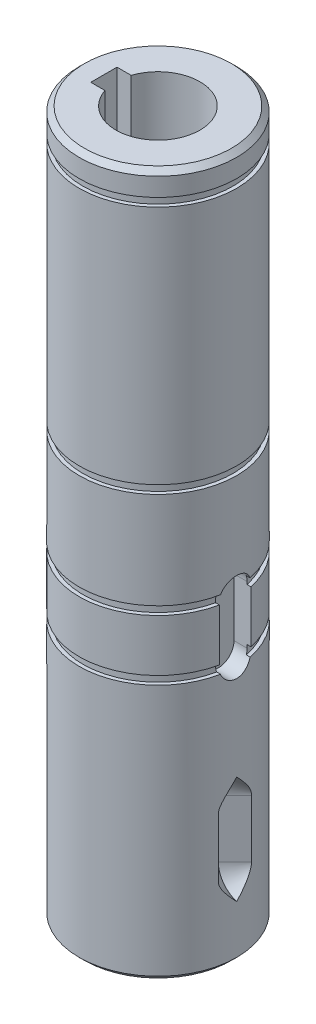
ISO-10303-21;
HEADER;
FILE_DESCRIPTION(('STEP AP214'),'2;1');
FILE_NAME('part.step','',(''),(''),'','','');
FILE_SCHEMA(('AUTOMOTIVE_DESIGN { 1 0 10303 214 1 1 1 1 }'));
ENDSEC;
DATA;
#1=APPLICATION_CONTEXT('core data for automotive mechanical design processes');
#2=APPLICATION_PROTOCOL_DEFINITION('international standard','automotive_design',2000,#1);
#3=PRODUCT_CONTEXT('',#1,'mechanical');
#4=PRODUCT('Part','Part','',(#3));
#5=PRODUCT_RELATED_PRODUCT_CATEGORY('part','',(#4));
#6=PRODUCT_DEFINITION_FORMATION('','',#4);
#7=PRODUCT_DEFINITION_CONTEXT('part definition',#1,'design');
#8=PRODUCT_DEFINITION('design','',#6,#7);
#9=PRODUCT_DEFINITION_SHAPE('','',#8);
#10=(LENGTH_UNIT() NAMED_UNIT(*) SI_UNIT(.MILLI.,.METRE.));
#11=(NAMED_UNIT(*) PLANE_ANGLE_UNIT() SI_UNIT($,.RADIAN.));
#12=(NAMED_UNIT(*) SI_UNIT($,.STERADIAN.) SOLID_ANGLE_UNIT());
#13=UNCERTAINTY_MEASURE_WITH_UNIT(LENGTH_MEASURE(1.E-05),#10,'distance_accuracy_value','');
#14=(GEOMETRIC_REPRESENTATION_CONTEXT(3) GLOBAL_UNCERTAINTY_ASSIGNED_CONTEXT((#13)) GLOBAL_UNIT_ASSIGNED_CONTEXT((#10,
#11,#12)) REPRESENTATION_CONTEXT('',''));
#15=CARTESIAN_POINT('',(0.,0.,0.));
#16=DIRECTION('',(0.,0.,1.));
#17=DIRECTION('',(1.,0.,0.));
#18=AXIS2_PLACEMENT_3D('',#15,#16,#17);
#19=CARTESIAN_POINT('',(0.,0.,0.));
#20=DIRECTION('',(0.,1.,0.));
#21=DIRECTION('',(0.,0.,1.));
#22=AXIS2_PLACEMENT_3D('',#19,#20,#21);
#23=CYLINDRICAL_SURFACE('',#22,15.);
#24=CARTESIAN_POINT('',(0.,-133.,0.));
#25=DIRECTION('',(0.,1.,0.));
#26=DIRECTION('',(0.,0.,1.));
#27=AXIS2_PLACEMENT_3D('',#24,#25,#26);
#28=CIRCLE('',#27,15.);
#29=CARTESIAN_POINT('',(0.,-133.,15.));
#30=VERTEX_POINT('',#29);
#31=EDGE_CURVE('E531',#30,#30,#28,.T.);
#32=ORIENTED_EDGE('',*,*,#31,.T.);
#33=EDGE_LOOP('',(#32));
#34=FACE_BOUND('',#33,.T.);
#35=CARTESIAN_POINT('',(14.7309198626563,-84.98,2.82842712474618));
#36=CARTESIAN_POINT('',(14.736332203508,-85.0597998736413,2.80022189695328));
#37=CARTESIAN_POINT('',(14.7423153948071,-85.1383592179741,2.76863972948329));
#38=CARTESIAN_POINT('',(14.7552259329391,-85.2924593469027,2.6989973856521));
#39=CARTESIAN_POINT('',(14.7621531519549,-85.3680005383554,2.66093808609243));
#40=CARTESIAN_POINT('',(14.7767495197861,-85.5154855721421,2.57864481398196));
#41=CARTESIAN_POINT('',(14.7844180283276,-85.5874324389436,2.53441615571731));
#42=CARTESIAN_POINT('',(14.8002768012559,-85.7272908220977,2.4401020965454));
#43=CARTESIAN_POINT('',(14.8084670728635,-85.7952022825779,2.39001661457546));
#44=CARTESIAN_POINT('',(14.8334756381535,-85.9921950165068,2.23146233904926));
#45=CARTESIAN_POINT('',(14.8507439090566,-86.1146524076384,2.1146298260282));
#46=CARTESIAN_POINT('',(14.884516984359,-86.3382019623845,1.86208484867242));
#47=CARTESIAN_POINT('',(14.9010218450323,-86.4392957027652,1.72637377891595));
#48=CARTESIAN_POINT('',(14.9315196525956,-86.6178145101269,1.43898053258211));
#49=CARTESIAN_POINT('',(14.945500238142,-86.6951243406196,1.28722523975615));
#50=CARTESIAN_POINT('',(14.969270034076,-86.8230660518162,0.972535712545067));
#51=CARTESIAN_POINT('',(14.9790592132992,-86.8736977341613,0.809601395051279));
#52=CARTESIAN_POINT('',(14.993228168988,-86.9461666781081,0.479582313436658));
#53=CARTESIAN_POINT('',(14.997680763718,-86.968391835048,0.312585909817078));
#54=CARTESIAN_POINT('',(15.0009197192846,-86.9846066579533,-0.0228117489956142));
#55=CARTESIAN_POINT('',(14.9997068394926,-86.9786001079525,-0.191212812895));
#56=CARTESIAN_POINT('',(14.9918088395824,-86.9388333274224,-0.522223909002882));
#57=CARTESIAN_POINT('',(14.9851986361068,-86.9054530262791,-0.684881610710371));
#58=CARTESIAN_POINT('',(14.9673242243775,-86.8124654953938,-1.00223850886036));
#59=CARTESIAN_POINT('',(14.9560599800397,-86.7528580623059,-1.15693764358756));
#60=CARTESIAN_POINT('',(14.9299995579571,-86.6086745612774,-1.45523515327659));
#61=CARTESIAN_POINT('',(14.9151792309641,-86.5239267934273,-1.59874833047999));
#62=CARTESIAN_POINT('',(14.8836418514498,-86.331963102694,-1.8697184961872));
#63=CARTESIAN_POINT('',(14.8669239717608,-86.2247373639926,-1.99716843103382));
#64=CARTESIAN_POINT('',(14.8330959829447,-85.9886365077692,-2.23471297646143));
#65=CARTESIAN_POINT('',(14.8159842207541,-85.8594072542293,-2.34445489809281));
#66=CARTESIAN_POINT('',(14.783611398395,-85.5842777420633,-2.54061819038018));
#67=CARTESIAN_POINT('',(14.7683474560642,-85.438404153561,-2.62707614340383));
#68=CARTESIAN_POINT('',(14.750469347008,-85.2365177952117,-2.72474718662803));
#69=CARTESIAN_POINT('',(14.7462480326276,-85.1860001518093,-2.74747893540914));
#70=CARTESIAN_POINT('',(14.7382452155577,-85.0838357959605,-2.79008893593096));
#71=CARTESIAN_POINT('',(14.7344630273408,-85.0321909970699,-2.80997164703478));
#72=CARTESIAN_POINT('',(14.7309198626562,-84.98,-2.82842712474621));
#73=B_SPLINE_CURVE_WITH_KNOTS('',3,(#35,#36,#37,#38,#39,#40,#41,#42,#43,#44,#45,#46,#47,#48,#49,
#50,#51,#52,#53,#54,#55,#56,#57,#58,#59,#60,#61,#62,#63,#64,#65,#66,#67,#68,#69,#70,#71,#72),
.UNSPECIFIED.,.F.,.F.,(4,2,2,2,2,2,2,2,2,2,2,2,2,2,2,2,2,2,4),(0.,0.254342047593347,
0.508649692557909,0.762739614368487,1.01683305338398,1.52461852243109,2.0323665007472,
2.54253719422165,3.05271168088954,3.55584250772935,4.05890589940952,4.55510297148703,
5.05130389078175,5.55097493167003,6.05086462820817,6.55972953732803,7.06779022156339,
7.23439863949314,7.40074336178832),.UNSPECIFIED.);
#74=CARTESIAN_POINT('',(14.7309198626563,-84.98,2.82842712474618));
#75=VERTEX_POINT('',#74);
#76=CARTESIAN_POINT('',(14.7309198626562,-84.98,-2.82842712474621));
#77=VERTEX_POINT('',#76);
#78=EDGE_CURVE('E309',#75,#77,#73,.T.);
#79=ORIENTED_EDGE('',*,*,#78,.F.);
#80=CARTESIAN_POINT('',(0.,-84.98,0.));
#81=DIRECTION('',(0.,1.,0.));
#82=DIRECTION('',(0.,0.,1.));
#83=AXIS2_PLACEMENT_3D('',#80,#81,#82);
#84=CIRCLE('',#83,15.);
#85=EDGE_CURVE('E443',#77,#75,#84,.T.);
#86=ORIENTED_EDGE('',*,*,#85,.F.);
#87=EDGE_LOOP('',(#79,#86));
#88=FACE_BOUND('',#87,.T.);
#89=CARTESIAN_POINT('',(14.9916576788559,-113.710661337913,-0.500200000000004));
#90=CARTESIAN_POINT('',(14.9943408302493,-113.793514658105,-0.419789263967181));
#91=CARTESIAN_POINT('',(14.9963711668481,-113.876521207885,-0.339516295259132));
#92=CARTESIAN_POINT('',(14.9991423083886,-114.04287477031,-0.179300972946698));
#93=CARTESIAN_POINT('',(14.9998831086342,-114.126221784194,-0.0993586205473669));
#94=CARTESIAN_POINT('',(15.0001955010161,-114.376961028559,0.1400201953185));
#95=CARTESIAN_POINT('',(14.9978527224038,-114.5449152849,0.298875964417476));
#96=CARTESIAN_POINT('',(14.9880510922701,-114.889490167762,0.620695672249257));
#97=CARTESIAN_POINT('',(14.9803914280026,-115.066188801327,0.783569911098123));
#98=CARTESIAN_POINT('',(14.9600582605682,-115.422318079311,1.10573486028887));
#99=CARTESIAN_POINT('',(14.9473885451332,-115.601746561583,1.26502818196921));
#100=CARTESIAN_POINT('',(14.9250189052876,-115.874059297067,1.50000741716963));
#101=CARTESIAN_POINT('',(14.9170004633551,-115.965368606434,1.57768190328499));
#102=CARTESIAN_POINT('',(14.8999460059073,-116.14929352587,1.73135167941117));
#103=CARTESIAN_POINT('',(14.8909100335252,-116.241909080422,1.80734704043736));
#104=CARTESIAN_POINT('',(14.8719297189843,-116.429011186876,1.95740659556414));
#105=CARTESIAN_POINT('',(14.8619830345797,-116.523502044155,2.03146514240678));
#106=CARTESIAN_POINT('',(14.841391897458,-116.714520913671,2.17680263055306));
#107=CARTESIAN_POINT('',(14.8307475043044,-116.811048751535,2.24808180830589));
#108=CARTESIAN_POINT('',(14.8092258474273,-117.004878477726,2.385705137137));
#109=CARTESIAN_POINT('',(14.7983564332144,-117.102133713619,2.45211581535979));
#110=CARTESIAN_POINT('',(14.7765549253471,-117.299777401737,2.58024130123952));
#111=CARTESIAN_POINT('',(14.7656228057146,-117.400167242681,2.64195398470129));
#112=CARTESIAN_POINT('',(14.7442644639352,-117.604247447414,2.75865278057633));
#113=CARTESIAN_POINT('',(14.7338361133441,-117.707920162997,2.81366902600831));
#114=CARTESIAN_POINT('',(14.7141543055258,-117.919564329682,2.91484389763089));
#115=CARTESIAN_POINT('',(14.7048993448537,-118.027530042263,2.96101389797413));
#116=CARTESIAN_POINT('',(14.6919374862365,-118.201803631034,3.02449107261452));
#117=CARTESIAN_POINT('',(14.6875309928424,-118.266606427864,3.04578508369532));
#118=CARTESIAN_POINT('',(14.6796368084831,-118.397679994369,3.08360765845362));
#119=CARTESIAN_POINT('',(14.6761493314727,-118.463951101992,3.10013511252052));
#120=CARTESIAN_POINT('',(14.6703055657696,-118.597408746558,3.12767228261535));
#121=CARTESIAN_POINT('',(14.6679446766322,-118.664590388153,3.13870444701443));
#122=CARTESIAN_POINT('',(14.6644891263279,-118.799693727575,3.15481024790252));
#123=CARTESIAN_POINT('',(14.6633942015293,-118.867615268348,3.15988512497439));
#124=CARTESIAN_POINT('',(14.6625469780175,-119.004017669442,3.16381426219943));
#125=CARTESIAN_POINT('',(14.6628019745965,-119.072499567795,3.16263472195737));
#126=CARTESIAN_POINT('',(14.6646523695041,-119.209047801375,3.15404333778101));
#127=CARTESIAN_POINT('',(14.6662478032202,-119.277114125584,3.14663132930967));
#128=CARTESIAN_POINT('',(14.670673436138,-119.412550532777,3.12593211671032));
#129=CARTESIAN_POINT('',(14.6735081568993,-119.479917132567,3.11262339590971));
#130=CARTESIAN_POINT('',(14.6802329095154,-119.613332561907,3.08075091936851));
#131=CARTESIAN_POINT('',(14.6841231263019,-119.679381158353,3.06218624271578));
#132=CARTESIAN_POINT('',(14.6952215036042,-119.847368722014,3.0085841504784));
#133=CARTESIAN_POINT('',(14.7030538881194,-119.948198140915,2.97020185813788));
#134=CARTESIAN_POINT('',(14.7200292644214,-120.146049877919,2.884896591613));
#135=CARTESIAN_POINT('',(14.7291732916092,-120.243069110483,2.83796686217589));
#136=CARTESIAN_POINT('',(14.7482164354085,-120.434535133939,2.73729053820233));
#137=CARTESIAN_POINT('',(14.7581217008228,-120.528950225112,2.68348544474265));
#138=CARTESIAN_POINT('',(14.7731224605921,-120.668314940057,2.59916764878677));
#139=CARTESIAN_POINT('',(14.7781457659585,-120.714386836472,2.57046456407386));
#140=CARTESIAN_POINT('',(14.7881952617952,-120.805856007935,2.51200316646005));
#141=CARTESIAN_POINT('',(14.7932214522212,-120.851253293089,2.48224486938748));
#142=CARTESIAN_POINT('',(14.8071727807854,-120.976908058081,2.39804587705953));
#143=CARTESIAN_POINT('',(14.8160550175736,-121.056498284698,2.34260215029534));
#144=CARTESIAN_POINT('',(14.8335103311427,-121.214059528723,2.22940776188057));
#145=CARTESIAN_POINT('',(14.8420833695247,-121.292030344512,2.17165681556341));
#146=CARTESIAN_POINT('',(14.8671294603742,-121.52399816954,1.99561426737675));
#147=CARTESIAN_POINT('',(14.8829219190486,-121.675985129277,1.87457795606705));
#148=CARTESIAN_POINT('',(14.9119758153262,-121.976554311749,1.62743136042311));
#149=CARTESIAN_POINT('',(14.9252314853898,-122.125128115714,1.501310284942));
#150=CARTESIAN_POINT('',(14.9487351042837,-122.419612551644,1.24570996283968));
#151=CARTESIAN_POINT('',(14.9589828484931,-122.565523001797,1.11623048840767));
#152=CARTESIAN_POINT('',(14.9755679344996,-122.844868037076,0.864364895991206));
#153=CARTESIAN_POINT('',(14.9821350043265,-122.978439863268,0.742145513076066));
#154=CARTESIAN_POINT('',(14.992297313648,-123.24428372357,0.496162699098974));
#155=CARTESIAN_POINT('',(14.9958923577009,-123.376555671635,0.37239916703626));
#156=CARTESIAN_POINT('',(14.9999952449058,-123.639413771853,0.124317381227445));
#157=CARTESIAN_POINT('',(15.0005179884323,-123.770004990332,4.73602000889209E-06));
#158=CARTESIAN_POINT('',(14.9984445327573,-124.030297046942,-0.249499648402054));
#159=CARTESIAN_POINT('',(14.9958486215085,-124.159997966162,-0.374691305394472));
#160=CARTESIAN_POINT('',(14.9916576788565,-124.289338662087,-0.50019999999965));
#161=B_SPLINE_CURVE_WITH_KNOTS('',3,(#89,#90,#91,#92,#93,#94,#95,#96,#97,#98,#99,#100,#101,#102,
#103,#104,#105,#106,#107,#108,#109,#110,#111,#112,#113,#114,#115,#116,#117,#118,#119,#120,#121,
#122,#123,#124,#125,#126,#127,#128,#129,#130,#131,#132,#133,#134,#135,#136,#137,#138,#139,#140,
#141,#142,#143,#144,#145,#146,#147,#148,#149,#150,#151,#152,#153,#154,#155,#156,#157,#158,#159,
#160),.UNSPECIFIED.,.F.,.F.,(4,2,2,2,2,2,2,2,2,2,2,2,2,2,2,2,2,2,2,2,2,2,2,2,2,2,2,2,2,2,2,2,2,
2,2,4),(0.,0.3464632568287,0.692927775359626,1.38642672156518,2.10765412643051,2.82833730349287,
3.18875698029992,3.54916138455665,3.91052024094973,4.27184828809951,4.62655052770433,
4.98141220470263,5.3346128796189,5.68735632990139,5.89226311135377,6.09721755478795,
6.30132774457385,6.5053954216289,6.71056705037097,6.91574409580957,7.12167606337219,
7.32764413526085,7.65157527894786,7.97576355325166,8.30292107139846,8.46645116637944,
8.62997880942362,8.9221336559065,9.21432466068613,9.79894569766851,10.3848805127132,
10.9708551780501,11.5143252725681,12.0578311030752,12.5986987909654,13.1395165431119),.UNSPECIFIED.);
#162=CARTESIAN_POINT('',(14.662771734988,-119.,3.16277173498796));
#163=VERTEX_POINT('',#162);
#164=CARTESIAN_POINT('',(15.,-123.769696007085,0.));
#165=VERTEX_POINT('',#164);
#166=EDGE_CURVE('E185',#163,#165,#161,.T.);
#167=ORIENTED_EDGE('',*,*,#166,.F.);
#168=DIRECTION('',(0.,1.,0.));
#169=VECTOR('',#168,1.);
#170=CARTESIAN_POINT('',(14.662771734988,0.,3.16277173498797));
#171=LINE('',#170,#169);
#172=CARTESIAN_POINT('',(14.662771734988,-108.,3.16277173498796));
#173=VERTEX_POINT('',#172);
#174=EDGE_CURVE('E40',#163,#173,#171,.T.);
#175=ORIENTED_EDGE('',*,*,#174,.T.);
#176=CARTESIAN_POINT('',(14.9916576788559,-113.289338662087,-0.500200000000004));
#177=CARTESIAN_POINT('',(14.9943408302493,-113.206485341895,-0.419789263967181));
#178=CARTESIAN_POINT('',(14.9963711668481,-113.123478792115,-0.339516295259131));
#179=CARTESIAN_POINT('',(14.9991423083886,-112.95712522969,-0.179300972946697));
#180=CARTESIAN_POINT('',(14.9998831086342,-112.873778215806,-0.0993586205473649));
#181=CARTESIAN_POINT('',(15.0001955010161,-112.623038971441,0.140020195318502));
#182=CARTESIAN_POINT('',(14.9978527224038,-112.4550847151,0.298875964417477));
#183=CARTESIAN_POINT('',(14.9880510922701,-112.110509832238,0.620695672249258));
#184=CARTESIAN_POINT('',(14.9803914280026,-111.933811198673,0.783569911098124));
#185=CARTESIAN_POINT('',(14.9600582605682,-111.577681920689,1.10573486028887));
#186=CARTESIAN_POINT('',(14.9473885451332,-111.398253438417,1.26502818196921));
#187=CARTESIAN_POINT('',(14.9250189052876,-111.125940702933,1.50000741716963));
#188=CARTESIAN_POINT('',(14.9170004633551,-111.034631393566,1.57768190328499));
#189=CARTESIAN_POINT('',(14.8999460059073,-110.85070647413,1.73135167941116));
#190=CARTESIAN_POINT('',(14.8909100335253,-110.758090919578,1.80734704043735));
#191=CARTESIAN_POINT('',(14.8719297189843,-110.570988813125,1.95740659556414));
#192=CARTESIAN_POINT('',(14.8619830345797,-110.476497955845,2.03146514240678));
#193=CARTESIAN_POINT('',(14.841391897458,-110.285479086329,2.17680263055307));
#194=CARTESIAN_POINT('',(14.8307475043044,-110.188951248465,2.2480818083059));
#195=CARTESIAN_POINT('',(14.8092258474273,-109.995121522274,2.385705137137));
#196=CARTESIAN_POINT('',(14.7983564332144,-109.897866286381,2.4521158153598));
#197=CARTESIAN_POINT('',(14.7765549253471,-109.700222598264,2.58024130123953));
#198=CARTESIAN_POINT('',(14.7656228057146,-109.599832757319,2.64195398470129));
#199=CARTESIAN_POINT('',(14.7442644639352,-109.395752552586,2.75865278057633));
#200=CARTESIAN_POINT('',(14.7338361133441,-109.292079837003,2.81366902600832));
#201=CARTESIAN_POINT('',(14.7141543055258,-109.080435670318,2.91484389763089));
#202=CARTESIAN_POINT('',(14.7048993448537,-108.972469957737,2.96101389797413));
#203=CARTESIAN_POINT('',(14.6919374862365,-108.798196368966,3.02449107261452));
#204=CARTESIAN_POINT('',(14.6875309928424,-108.733393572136,3.04578508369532));
#205=CARTESIAN_POINT('',(14.6796368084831,-108.602320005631,3.08360765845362));
#206=CARTESIAN_POINT('',(14.6761493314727,-108.536048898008,3.10013511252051));
#207=CARTESIAN_POINT('',(14.6703055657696,-108.402591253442,3.12767228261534));
#208=CARTESIAN_POINT('',(14.6679446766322,-108.335409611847,3.13870444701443));
#209=CARTESIAN_POINT('',(14.6644891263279,-108.200306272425,3.15481024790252));
#210=CARTESIAN_POINT('',(14.6633942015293,-108.132384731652,3.15988512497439));
#211=CARTESIAN_POINT('',(14.6625469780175,-107.995982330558,3.16381426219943));
#212=CARTESIAN_POINT('',(14.6628019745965,-107.927500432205,3.16263472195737));
#213=CARTESIAN_POINT('',(14.6646523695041,-107.790952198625,3.15404333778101));
#214=CARTESIAN_POINT('',(14.6662478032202,-107.722885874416,3.14663132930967));
#215=CARTESIAN_POINT('',(14.670673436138,-107.587449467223,3.12593211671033));
#216=CARTESIAN_POINT('',(14.6735081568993,-107.520082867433,3.11262339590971));
#217=CARTESIAN_POINT('',(14.6802329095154,-107.386667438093,3.08075091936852));
#218=CARTESIAN_POINT('',(14.6841231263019,-107.320618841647,3.06218624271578));
#219=CARTESIAN_POINT('',(14.6952215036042,-107.152631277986,3.0085841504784));
#220=CARTESIAN_POINT('',(14.7030538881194,-107.051801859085,2.97020185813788));
#221=CARTESIAN_POINT('',(14.7200292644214,-106.853950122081,2.884896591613));
#222=CARTESIAN_POINT('',(14.7291732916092,-106.756930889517,2.8379668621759));
#223=CARTESIAN_POINT('',(14.7482164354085,-106.565464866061,2.73729053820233));
#224=CARTESIAN_POINT('',(14.7581217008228,-106.471049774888,2.68348544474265));
#225=CARTESIAN_POINT('',(14.7731224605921,-106.331685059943,2.59916764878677));
#226=CARTESIAN_POINT('',(14.7781457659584,-106.285613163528,2.57046456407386));
#227=CARTESIAN_POINT('',(14.7881952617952,-106.194143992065,2.51200316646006));
#228=CARTESIAN_POINT('',(14.7932214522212,-106.148746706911,2.48224486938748));
#229=CARTESIAN_POINT('',(14.8071727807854,-106.023091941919,2.39804587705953));
#230=CARTESIAN_POINT('',(14.8160550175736,-105.943501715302,2.34260215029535));
#231=CARTESIAN_POINT('',(14.8335103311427,-105.785940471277,2.22940776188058));
#232=CARTESIAN_POINT('',(14.8420833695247,-105.707969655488,2.17165681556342));
#233=CARTESIAN_POINT('',(14.8671294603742,-105.47600183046,1.99561426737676));
#234=CARTESIAN_POINT('',(14.8829219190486,-105.324014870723,1.87457795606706));
#235=CARTESIAN_POINT('',(14.9119758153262,-105.023445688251,1.62743136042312));
#236=CARTESIAN_POINT('',(14.9252314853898,-104.874871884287,1.501310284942));
#237=CARTESIAN_POINT('',(14.9487351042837,-104.580387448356,1.24570996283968));
#238=CARTESIAN_POINT('',(14.9589828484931,-104.434476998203,1.11623048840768));
#239=CARTESIAN_POINT('',(14.9755679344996,-104.155131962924,0.864364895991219));
#240=CARTESIAN_POINT('',(14.9821350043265,-104.021560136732,0.742145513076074));
#241=CARTESIAN_POINT('',(14.992297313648,-103.75571627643,0.496162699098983));
#242=CARTESIAN_POINT('',(14.9958923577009,-103.623444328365,0.372399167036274));
#243=CARTESIAN_POINT('',(14.9999952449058,-103.360586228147,0.124317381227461));
#244=CARTESIAN_POINT('',(15.0005179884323,-103.229995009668,4.7360200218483E-06));
#245=CARTESIAN_POINT('',(14.9984445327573,-102.969702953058,-0.249499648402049));
#246=CARTESIAN_POINT('',(14.9958486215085,-102.840002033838,-0.374691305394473));
#247=CARTESIAN_POINT('',(14.9916576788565,-102.710661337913,-0.50019999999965));
#248=B_SPLINE_CURVE_WITH_KNOTS('',3,(#176,#177,#178,#179,#180,#181,#182,#183,#184,#185,#186,
#187,#188,#189,#190,#191,#192,#193,#194,#195,#196,#197,#198,#199,#200,#201,#202,#203,#204,#205,
#206,#207,#208,#209,#210,#211,#212,#213,#214,#215,#216,#217,#218,#219,#220,#221,#222,#223,#224,
#225,#226,#227,#228,#229,#230,#231,#232,#233,#234,#235,#236,#237,#238,#239,#240,#241,#242,#243,
#244,#245,#246,#247),.UNSPECIFIED.,.F.,.F.,(4,2,2,2,2,2,2,2,2,2,2,2,2,2,2,2,2,2,2,2,2,2,2,2,2,2,
2,2,2,2,2,2,2,2,2,4),(0.,0.346463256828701,0.692927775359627,1.38642672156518,2.10765412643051,
2.82833730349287,3.18875698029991,3.54916138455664,3.91052024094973,4.27184828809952,
4.62655052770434,4.98141220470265,5.33461287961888,5.68735632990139,5.89226311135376,
6.09721755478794,6.30132774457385,6.5053954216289,6.71056705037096,6.91574409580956,
7.12167606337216,7.32764413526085,7.65157527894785,7.97576355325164,8.30292107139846,
8.46645116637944,8.62997880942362,8.92213365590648,9.21432466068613,9.79894569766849,
10.3848805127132,10.9708551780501,11.5143252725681,12.0578311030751,12.5986987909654,
13.1395165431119),.UNSPECIFIED.);
#249=CARTESIAN_POINT('',(15.,-103.230303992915,0.));
#250=VERTEX_POINT('',#249);
#251=EDGE_CURVE('E179',#173,#250,#248,.T.);
#252=ORIENTED_EDGE('',*,*,#251,.T.);
#253=CARTESIAN_POINT('',(14.9916576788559,-102.710661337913,0.500200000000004));
#254=CARTESIAN_POINT('',(14.9943408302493,-102.793514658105,0.419789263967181));
#255=CARTESIAN_POINT('',(14.9963711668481,-102.876521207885,0.339516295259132));
#256=CARTESIAN_POINT('',(14.9991423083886,-103.04287477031,0.179300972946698));
#257=CARTESIAN_POINT('',(14.9998831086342,-103.126221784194,0.0993586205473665));
#258=CARTESIAN_POINT('',(15.0001955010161,-103.376961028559,-0.1400201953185));
#259=CARTESIAN_POINT('',(14.9978527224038,-103.5449152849,-0.298875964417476));
#260=CARTESIAN_POINT('',(14.9880510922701,-103.889490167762,-0.620695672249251));
#261=CARTESIAN_POINT('',(14.9803914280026,-104.066188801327,-0.783569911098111));
#262=CARTESIAN_POINT('',(14.9600582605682,-104.422318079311,-1.10573486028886));
#263=CARTESIAN_POINT('',(14.9473885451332,-104.601746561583,-1.26502818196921));
#264=CARTESIAN_POINT('',(14.9250189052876,-104.874059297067,-1.50000741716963));
#265=CARTESIAN_POINT('',(14.9170004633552,-104.965368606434,-1.57768190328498));
#266=CARTESIAN_POINT('',(14.8999460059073,-105.14929352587,-1.73135167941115));
#267=CARTESIAN_POINT('',(14.8909100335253,-105.241909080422,-1.80734704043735));
#268=CARTESIAN_POINT('',(14.8719297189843,-105.429011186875,-1.95740659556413));
#269=CARTESIAN_POINT('',(14.8619830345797,-105.523502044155,-2.03146514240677));
#270=CARTESIAN_POINT('',(14.841391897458,-105.714520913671,-2.17680263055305));
#271=CARTESIAN_POINT('',(14.8307475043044,-105.811048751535,-2.24808180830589));
#272=CARTESIAN_POINT('',(14.8092258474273,-106.004878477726,-2.385705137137));
#273=CARTESIAN_POINT('',(14.7983564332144,-106.102133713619,-2.45211581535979));
#274=CARTESIAN_POINT('',(14.7765549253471,-106.299777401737,-2.58024130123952));
#275=CARTESIAN_POINT('',(14.7656228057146,-106.400167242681,-2.64195398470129));
#276=CARTESIAN_POINT('',(14.7442644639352,-106.604247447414,-2.75865278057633));
#277=CARTESIAN_POINT('',(14.7338361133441,-106.707920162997,-2.81366902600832));
#278=CARTESIAN_POINT('',(14.7141543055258,-106.919564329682,-2.91484389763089));
#279=CARTESIAN_POINT('',(14.7048993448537,-107.027530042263,-2.96101389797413));
#280=CARTESIAN_POINT('',(14.6919374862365,-107.201803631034,-3.02449107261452));
#281=CARTESIAN_POINT('',(14.6875309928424,-107.266606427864,-3.04578508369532));
#282=CARTESIAN_POINT('',(14.6796368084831,-107.397679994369,-3.08360765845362));
#283=CARTESIAN_POINT('',(14.6761493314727,-107.463951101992,-3.10013511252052));
#284=CARTESIAN_POINT('',(14.6703055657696,-107.597408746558,-3.12767228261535));
#285=CARTESIAN_POINT('',(14.6679446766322,-107.664590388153,-3.13870444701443));
#286=CARTESIAN_POINT('',(14.6644891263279,-107.799693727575,-3.15481024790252));
#287=CARTESIAN_POINT('',(14.6633942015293,-107.867615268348,-3.1598851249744));
#288=CARTESIAN_POINT('',(14.6625469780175,-108.004017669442,-3.16381426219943));
#289=CARTESIAN_POINT('',(14.6628019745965,-108.072499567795,-3.16263472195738));
#290=CARTESIAN_POINT('',(14.6646523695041,-108.209047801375,-3.15404333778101));
#291=CARTESIAN_POINT('',(14.6662478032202,-108.277114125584,-3.14663132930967));
#292=CARTESIAN_POINT('',(14.670673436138,-108.412550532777,-3.12593211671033));
#293=CARTESIAN_POINT('',(14.6735081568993,-108.479917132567,-3.11262339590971));
#294=CARTESIAN_POINT('',(14.6802329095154,-108.613332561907,-3.08075091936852));
#295=CARTESIAN_POINT('',(14.6841231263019,-108.679381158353,-3.06218624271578));
#296=CARTESIAN_POINT('',(14.6952215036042,-108.847368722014,-3.0085841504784));
#297=CARTESIAN_POINT('',(14.7030538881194,-108.948198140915,-2.97020185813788));
#298=CARTESIAN_POINT('',(14.7200292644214,-109.146049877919,-2.88489659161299));
#299=CARTESIAN_POINT('',(14.7291732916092,-109.243069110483,-2.83796686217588));
#300=CARTESIAN_POINT('',(14.7482164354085,-109.434535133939,-2.73729053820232));
#301=CARTESIAN_POINT('',(14.7581217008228,-109.528950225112,-2.68348544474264));
#302=CARTESIAN_POINT('',(14.7731224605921,-109.668314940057,-2.59916764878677));
#303=CARTESIAN_POINT('',(14.7781457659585,-109.714386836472,-2.57046456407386));
#304=CARTESIAN_POINT('',(14.7881952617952,-109.805856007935,-2.51200316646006));
#305=CARTESIAN_POINT('',(14.7932214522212,-109.851253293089,-2.48224486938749));
#306=CARTESIAN_POINT('',(14.8071727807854,-109.976908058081,-2.39804587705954));
#307=CARTESIAN_POINT('',(14.8160550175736,-110.056498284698,-2.34260215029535));
#308=CARTESIAN_POINT('',(14.8335103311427,-110.214059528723,-2.22940776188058));
#309=CARTESIAN_POINT('',(14.8420833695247,-110.292030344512,-2.17165681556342));
#310=CARTESIAN_POINT('',(14.8671294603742,-110.52399816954,-1.99561426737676));
#311=CARTESIAN_POINT('',(14.8829219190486,-110.675985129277,-1.87457795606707));
#312=CARTESIAN_POINT('',(14.9119758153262,-110.976554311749,-1.62743136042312));
#313=CARTESIAN_POINT('',(14.9252314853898,-111.125128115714,-1.501310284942));
#314=CARTESIAN_POINT('',(14.9487351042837,-111.419612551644,-1.24570996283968));
#315=CARTESIAN_POINT('',(14.9589828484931,-111.565523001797,-1.11623048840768));
#316=CARTESIAN_POINT('',(14.9755679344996,-111.844868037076,-0.864364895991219));
#317=CARTESIAN_POINT('',(14.9821350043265,-111.978439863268,-0.742145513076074));
#318=CARTESIAN_POINT('',(14.992297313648,-112.24428372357,-0.496162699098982));
#319=CARTESIAN_POINT('',(14.9958923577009,-112.376555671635,-0.372399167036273));
#320=CARTESIAN_POINT('',(14.9999952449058,-112.639413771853,-0.12431738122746));
#321=CARTESIAN_POINT('',(15.0005179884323,-112.770004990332,-4.73602002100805E-06));
#322=CARTESIAN_POINT('',(14.9984445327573,-113.030297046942,0.24949964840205));
#323=CARTESIAN_POINT('',(14.9958486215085,-113.159997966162,0.374691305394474));
#324=CARTESIAN_POINT('',(14.9916576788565,-113.289338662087,0.50019999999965));
#325=B_SPLINE_CURVE_WITH_KNOTS('',3,(#253,#254,#255,#256,#257,#258,#259,#260,#261,#262,#263,
#264,#265,#266,#267,#268,#269,#270,#271,#272,#273,#274,#275,#276,#277,#278,#279,#280,#281,#282,
#283,#284,#285,#286,#287,#288,#289,#290,#291,#292,#293,#294,#295,#296,#297,#298,#299,#300,#301,
#302,#303,#304,#305,#306,#307,#308,#309,#310,#311,#312,#313,#314,#315,#316,#317,#318,#319,#320,
#321,#322,#323,#324),.UNSPECIFIED.,.F.,.F.,(4,2,2,2,2,2,2,2,2,2,2,2,2,2,2,2,2,2,2,2,2,2,2,2,2,2,
2,2,2,2,2,2,2,2,2,4),(0.,0.346463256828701,0.692927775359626,1.38642672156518,2.10765412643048,
2.82833730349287,3.18875698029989,3.54916138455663,3.91052024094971,4.27184828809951,
4.62655052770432,4.98141220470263,5.33461287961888,5.68735632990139,5.89226311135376,
6.09721755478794,6.30132774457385,6.5053954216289,6.71056705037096,6.91574409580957,
7.12167606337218,7.32764413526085,7.65157527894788,7.97576355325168,8.30292107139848,
8.46645116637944,8.62997880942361,8.9221336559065,9.21432466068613,9.7989456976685,
10.3848805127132,10.9708551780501,11.5143252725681,12.0578311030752,12.5986987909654,
13.1395165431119),.UNSPECIFIED.);
#326=CARTESIAN_POINT('',(14.6627717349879,-108.,-3.16277173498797));
#327=VERTEX_POINT('',#326);
#328=EDGE_CURVE('E319',#250,#327,#325,.T.);
#329=ORIENTED_EDGE('',*,*,#328,.T.);
#330=DIRECTION('',(0.,1.,0.));
#331=VECTOR('',#330,1.);
#332=CARTESIAN_POINT('',(14.662771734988,0.,-3.16277173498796));
#333=LINE('',#332,#331);
#334=CARTESIAN_POINT('',(14.6627717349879,-119.,-3.16277173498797));
#335=VERTEX_POINT('',#334);
#336=EDGE_CURVE('E11',#327,#335,#333,.F.);
#337=ORIENTED_EDGE('',*,*,#336,.T.);
#338=CARTESIAN_POINT('',(14.9916576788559,-124.289338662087,0.500200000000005));
#339=CARTESIAN_POINT('',(14.9943408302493,-124.206485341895,0.419789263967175));
#340=CARTESIAN_POINT('',(14.9963711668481,-124.123478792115,0.339516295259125));
#341=CARTESIAN_POINT('',(14.9991423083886,-123.95712522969,0.179300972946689));
#342=CARTESIAN_POINT('',(14.9998831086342,-123.873778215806,0.0993586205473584));
#343=CARTESIAN_POINT('',(15.0001955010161,-123.623038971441,-0.140020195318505));
#344=CARTESIAN_POINT('',(14.9978527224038,-123.4550847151,-0.298875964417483));
#345=CARTESIAN_POINT('',(14.9880510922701,-123.110509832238,-0.620695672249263));
#346=CARTESIAN_POINT('',(14.9803914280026,-122.933811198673,-0.783569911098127));
#347=CARTESIAN_POINT('',(14.9600582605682,-122.577681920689,-1.10573486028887));
#348=CARTESIAN_POINT('',(14.9473885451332,-122.398253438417,-1.26502818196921));
#349=CARTESIAN_POINT('',(14.9250189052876,-122.125940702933,-1.50000741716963));
#350=CARTESIAN_POINT('',(14.9170004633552,-122.034631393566,-1.57768190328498));
#351=CARTESIAN_POINT('',(14.8999460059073,-121.85070647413,-1.73135167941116));
#352=CARTESIAN_POINT('',(14.8909100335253,-121.758090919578,-1.80734704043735));
#353=CARTESIAN_POINT('',(14.8719297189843,-121.570988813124,-1.95740659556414));
#354=CARTESIAN_POINT('',(14.8619830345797,-121.476497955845,-2.03146514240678));
#355=CARTESIAN_POINT('',(14.841391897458,-121.285479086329,-2.17680263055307));
#356=CARTESIAN_POINT('',(14.8307475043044,-121.188951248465,-2.24808180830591));
#357=CARTESIAN_POINT('',(14.8092258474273,-120.995121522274,-2.38570513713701));
#358=CARTESIAN_POINT('',(14.7983564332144,-120.897866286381,-2.4521158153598));
#359=CARTESIAN_POINT('',(14.7765549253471,-120.700222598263,-2.58024130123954));
#360=CARTESIAN_POINT('',(14.7656228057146,-120.599832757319,-2.6419539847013));
#361=CARTESIAN_POINT('',(14.7442644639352,-120.395752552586,-2.75865278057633));
#362=CARTESIAN_POINT('',(14.7338361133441,-120.292079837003,-2.81366902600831));
#363=CARTESIAN_POINT('',(14.7141543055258,-120.080435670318,-2.91484389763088));
#364=CARTESIAN_POINT('',(14.7048993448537,-119.972469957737,-2.96101389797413));
#365=CARTESIAN_POINT('',(14.6919374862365,-119.798196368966,-3.02449107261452));
#366=CARTESIAN_POINT('',(14.6875309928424,-119.733393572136,-3.04578508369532));
#367=CARTESIAN_POINT('',(14.6796368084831,-119.602320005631,-3.08360765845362));
#368=CARTESIAN_POINT('',(14.6761493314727,-119.536048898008,-3.10013511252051));
#369=CARTESIAN_POINT('',(14.6703055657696,-119.402591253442,-3.12767228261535));
#370=CARTESIAN_POINT('',(14.6679446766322,-119.335409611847,-3.13870444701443));
#371=CARTESIAN_POINT('',(14.6644891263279,-119.200306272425,-3.15481024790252));
#372=CARTESIAN_POINT('',(14.6633942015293,-119.132384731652,-3.1598851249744));
#373=CARTESIAN_POINT('',(14.6625469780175,-118.995982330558,-3.16381426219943));
#374=CARTESIAN_POINT('',(14.6628019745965,-118.927500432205,-3.16263472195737));
#375=CARTESIAN_POINT('',(14.6646523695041,-118.790952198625,-3.154043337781));
#376=CARTESIAN_POINT('',(14.6662478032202,-118.722885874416,-3.14663132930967));
#377=CARTESIAN_POINT('',(14.670673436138,-118.587449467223,-3.12593211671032));
#378=CARTESIAN_POINT('',(14.6735081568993,-118.520082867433,-3.1126233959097));
#379=CARTESIAN_POINT('',(14.6802329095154,-118.386667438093,-3.08075091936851));
#380=CARTESIAN_POINT('',(14.6841231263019,-118.320618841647,-3.06218624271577));
#381=CARTESIAN_POINT('',(14.6952215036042,-118.152631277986,-3.00858415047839));
#382=CARTESIAN_POINT('',(14.7030538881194,-118.051801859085,-2.97020185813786));
#383=CARTESIAN_POINT('',(14.7200292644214,-117.853950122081,-2.88489659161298));
#384=CARTESIAN_POINT('',(14.7291732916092,-117.756930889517,-2.83796686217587));
#385=CARTESIAN_POINT('',(14.7482164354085,-117.565464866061,-2.73729053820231));
#386=CARTESIAN_POINT('',(14.7581217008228,-117.471049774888,-2.68348544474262));
#387=CARTESIAN_POINT('',(14.7731224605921,-117.331685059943,-2.59916764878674));
#388=CARTESIAN_POINT('',(14.7781457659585,-117.285613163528,-2.57046456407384));
#389=CARTESIAN_POINT('',(14.7881952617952,-117.194143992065,-2.51200316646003));
#390=CARTESIAN_POINT('',(14.7932214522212,-117.148746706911,-2.48224486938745));
#391=CARTESIAN_POINT('',(14.8071727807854,-117.023091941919,-2.39804587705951));
#392=CARTESIAN_POINT('',(14.8160550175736,-116.943501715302,-2.34260215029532));
#393=CARTESIAN_POINT('',(14.8335103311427,-116.785940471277,-2.22940776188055));
#394=CARTESIAN_POINT('',(14.8420833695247,-116.707969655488,-2.17165681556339));
#395=CARTESIAN_POINT('',(14.8671294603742,-116.47600183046,-1.99561426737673));
#396=CARTESIAN_POINT('',(14.8829219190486,-116.324014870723,-1.87457795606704));
#397=CARTESIAN_POINT('',(14.9119758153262,-116.023445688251,-1.62743136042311));
#398=CARTESIAN_POINT('',(14.9252314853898,-115.874871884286,-1.50131028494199));
#399=CARTESIAN_POINT('',(14.9487351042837,-115.580387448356,-1.24570996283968));
#400=CARTESIAN_POINT('',(14.9589828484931,-115.434476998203,-1.11623048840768));
#401=CARTESIAN_POINT('',(14.9755679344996,-115.155131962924,-0.864364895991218));
#402=CARTESIAN_POINT('',(14.9821350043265,-115.021560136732,-0.742145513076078));
#403=CARTESIAN_POINT('',(14.992297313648,-114.75571627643,-0.496162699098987));
#404=CARTESIAN_POINT('',(14.9958923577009,-114.623444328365,-0.372399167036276));
#405=CARTESIAN_POINT('',(14.9999952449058,-114.360586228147,-0.12431738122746));
#406=CARTESIAN_POINT('',(15.0005179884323,-114.229995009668,-4.736020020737E-06));
#407=CARTESIAN_POINT('',(14.9984445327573,-113.969702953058,0.249499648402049));
#408=CARTESIAN_POINT('',(14.9958486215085,-113.840002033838,0.374691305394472));
#409=CARTESIAN_POINT('',(14.9916576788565,-113.710661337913,0.500199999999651));
#410=B_SPLINE_CURVE_WITH_KNOTS('',3,(#338,#339,#340,#341,#342,#343,#344,#345,#346,#347,#348,
#349,#350,#351,#352,#353,#354,#355,#356,#357,#358,#359,#360,#361,#362,#363,#364,#365,#366,#367,
#368,#369,#370,#371,#372,#373,#374,#375,#376,#377,#378,#379,#380,#381,#382,#383,#384,#385,#386,
#387,#388,#389,#390,#391,#392,#393,#394,#395,#396,#397,#398,#399,#400,#401,#402,#403,#404,#405,
#406,#407,#408,#409),.UNSPECIFIED.,.F.,.F.,(4,2,2,2,2,2,2,2,2,2,2,2,2,2,2,2,2,2,2,2,2,2,2,2,2,2,
2,2,2,2,2,2,2,2,2,4),(0.,0.346463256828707,0.692927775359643,1.3864267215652,2.10765412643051,
2.82833730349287,3.18875698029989,3.54916138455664,3.91052024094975,4.27184828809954,
4.62655052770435,4.98141220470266,5.33461287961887,5.68735632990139,5.89226311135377,
6.09721755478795,6.30132774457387,6.50539542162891,6.710567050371,6.9157440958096,
7.12167606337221,7.32764413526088,7.65157527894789,7.97576355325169,8.30292107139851,
8.46645116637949,8.62997880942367,8.92213365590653,9.21432466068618,9.79894569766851,
10.3848805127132,10.9708551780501,11.5143252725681,12.0578311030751,12.5986987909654,
13.1395165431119),.UNSPECIFIED.);
#411=EDGE_CURVE('E174',#165,#335,#410,.T.);
#412=ORIENTED_EDGE('',*,*,#411,.F.);
#413=EDGE_LOOP('',(#167,#175,#252,#329,#337,#412));
#414=FACE_BOUND('',#413,.T.);
#415=ADVANCED_FACE('F32',(#34,#88,#414),#23,.T.);
#416=CARTESIAN_POINT('',(0.,0.,0.));
#417=DIRECTION('',(0.,1.,0.));
#418=DIRECTION('',(0.,0.,1.));
#419=AXIS2_PLACEMENT_3D('',#416,#417,#418);
#420=CYLINDRICAL_SURFACE('',#419,8.00000000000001);
#421=CARTESIAN_POINT('',(0.,-29.,0.));
#422=DIRECTION('',(0.,-1.,0.));
#423=DIRECTION('',(0.,0.,-1.));
#424=AXIS2_PLACEMENT_3D('',#421,#422,#423);
#425=CIRCLE('',#424,8.00000000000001);
#426=CARTESIAN_POINT('',(-7.59934207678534,-29.,2.5));
#427=VERTEX_POINT('',#426);
#428=CARTESIAN_POINT('',(-7.59934207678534,-29.,-2.5));
#429=VERTEX_POINT('',#428);
#430=EDGE_CURVE('E47',#427,#429,#425,.F.);
#431=ORIENTED_EDGE('',*,*,#430,.F.);
#432=DIRECTION('',(0.,1.,0.));
#433=VECTOR('',#432,1.);
#434=CARTESIAN_POINT('',(-7.59934207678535,0.,2.5));
#435=LINE('',#434,#433);
#436=CARTESIAN_POINT('',(-7.59934207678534,0.,2.5));
#437=VERTEX_POINT('',#436);
#438=EDGE_CURVE('E455',#437,#427,#435,.F.);
#439=ORIENTED_EDGE('',*,*,#438,.F.);
#440=CARTESIAN_POINT('',(0.,0.,0.));
#441=DIRECTION('',(0.,1.,0.));
#442=DIRECTION('',(0.,0.,1.));
#443=AXIS2_PLACEMENT_3D('',#440,#441,#442);
#444=CIRCLE('',#443,8.00000000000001);
#445=CARTESIAN_POINT('',(-7.59934207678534,0.,-2.5));
#446=VERTEX_POINT('',#445);
#447=EDGE_CURVE('E271',#437,#446,#444,.T.);
#448=ORIENTED_EDGE('',*,*,#447,.T.);
#449=DIRECTION('',(0.,1.,0.));
#450=VECTOR('',#449,1.);
#451=CARTESIAN_POINT('',(-7.59934207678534,0.,-2.5));
#452=LINE('',#451,#450);
#453=EDGE_CURVE('E453',#429,#446,#452,.T.);
#454=ORIENTED_EDGE('',*,*,#453,.F.);
#455=EDGE_LOOP('',(#431,#439,#448,#454));
#456=FACE_BOUND('',#455,.T.);
#457=ADVANCED_FACE('F290',(#456),#420,.F.);
#458=CARTESIAN_POINT('',(-4.23524165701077,-134.001,2.5));
#459=DIRECTION('',(0.,0.,1.));
#460=DIRECTION('',(1.,0.,0.));
#461=AXIS2_PLACEMENT_3D('',#458,#459,#460);
#462=PLANE('',#461);
#463=DIRECTION('',(1.,0.,0.));
#464=VECTOR('',#463,1.);
#465=CARTESIAN_POINT('',(-4.23524165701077,-29.,2.5));
#466=LINE('',#465,#464);
#467=CARTESIAN_POINT('',(-10.3,-29.,2.5));
#468=VERTEX_POINT('',#467);
#469=EDGE_CURVE('E212',#468,#427,#466,.T.);
#470=ORIENTED_EDGE('',*,*,#469,.F.);
#471=DIRECTION('',(0.,1.,0.));
#472=VECTOR('',#471,1.);
#473=CARTESIAN_POINT('',(-10.3,-134.001,2.5));
#474=LINE('',#473,#472);
#475=CARTESIAN_POINT('',(-10.3,0.,2.5));
#476=VERTEX_POINT('',#475);
#477=EDGE_CURVE('E473',#468,#476,#474,.T.);
#478=ORIENTED_EDGE('',*,*,#477,.T.);
#479=DIRECTION('',(1.,0.,0.));
#480=VECTOR('',#479,1.);
#481=CARTESIAN_POINT('',(-4.23524165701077,0.,2.5));
#482=LINE('',#481,#480);
#483=EDGE_CURVE('E460',#476,#437,#482,.T.);
#484=ORIENTED_EDGE('',*,*,#483,.T.);
#485=ORIENTED_EDGE('',*,*,#438,.T.);
#486=EDGE_LOOP('',(#470,#478,#484,#485));
#487=FACE_BOUND('',#486,.T.);
#488=ADVANCED_FACE('F296',(#487),#462,.F.);
#489=CARTESIAN_POINT('',(-10.3,-134.001,-2.5));
#490=DIRECTION('',(-1.,0.,0.));
#491=DIRECTION('',(0.,0.,1.));
#492=AXIS2_PLACEMENT_3D('',#489,#490,#491);
#493=PLANE('',#492);
#494=DIRECTION('',(0.,0.,1.));
#495=VECTOR('',#494,1.);
#496=CARTESIAN_POINT('',(-10.3,-29.,-2.5));
#497=LINE('',#496,#495);
#498=CARTESIAN_POINT('',(-10.3,-29.,-2.5));
#499=VERTEX_POINT('',#498);
#500=EDGE_CURVE('E210',#499,#468,#497,.T.);
#501=ORIENTED_EDGE('',*,*,#500,.F.);
#502=DIRECTION('',(0.,1.,0.));
#503=VECTOR('',#502,1.);
#504=CARTESIAN_POINT('',(-10.3,-134.001,-2.5));
#505=LINE('',#504,#503);
#506=CARTESIAN_POINT('',(-10.3,0.,-2.5));
#507=VERTEX_POINT('',#506);
#508=EDGE_CURVE('E468',#499,#507,#505,.T.);
#509=ORIENTED_EDGE('',*,*,#508,.T.);
#510=DIRECTION('',(0.,0.,1.));
#511=VECTOR('',#510,1.);
#512=CARTESIAN_POINT('',(-10.3,0.,-2.5));
#513=LINE('',#512,#511);
#514=EDGE_CURVE('E464',#507,#476,#513,.T.);
#515=ORIENTED_EDGE('',*,*,#514,.T.);
#516=ORIENTED_EDGE('',*,*,#477,.F.);
#517=EDGE_LOOP('',(#501,#509,#515,#516));
#518=FACE_BOUND('',#517,.T.);
#519=ADVANCED_FACE('F260',(#518),#493,.F.);
#520=CARTESIAN_POINT('',(-4.23524165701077,-134.001,-2.5));
#521=DIRECTION('',(0.,0.,-1.));
#522=DIRECTION('',(-1.,0.,0.));
#523=AXIS2_PLACEMENT_3D('',#520,#521,#522);
#524=PLANE('',#523);
#525=DIRECTION('',(-1.,0.,0.));
#526=VECTOR('',#525,1.);
#527=CARTESIAN_POINT('',(-4.23524165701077,-29.,-2.5));
#528=LINE('',#527,#526);
#529=EDGE_CURVE('E527',#429,#499,#528,.T.);
#530=ORIENTED_EDGE('',*,*,#529,.F.);
#531=ORIENTED_EDGE('',*,*,#453,.T.);
#532=DIRECTION('',(-1.,0.,0.));
#533=VECTOR('',#532,1.);
#534=CARTESIAN_POINT('',(-4.23524165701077,0.,-2.5));
#535=LINE('',#534,#533);
#536=EDGE_CURVE('E462',#446,#507,#535,.T.);
#537=ORIENTED_EDGE('',*,*,#536,.T.);
#538=ORIENTED_EDGE('',*,*,#508,.F.);
#539=EDGE_LOOP('',(#530,#531,#537,#538));
#540=FACE_BOUND('',#539,.T.);
#541=ADVANCED_FACE('F526',(#540),#524,.F.);
#542=CARTESIAN_POINT('',(14.3,-84.98,0.));
#543=DIRECTION('',(0.,-1.,0.));
#544=DIRECTION('',(0.,0.,-1.));
#545=AXIS2_PLACEMENT_3D('',#542,#543,#544);
#546=PLANE('',#545);
#547=DIRECTION('',(-1.,0.,0.));
#548=VECTOR('',#547,1.);
#549=CARTESIAN_POINT('',(21.5,-84.98,2.82842712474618));
#550=LINE('',#549,#548);
#551=CARTESIAN_POINT('',(14.0174890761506,-84.98,2.82842712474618));
#552=VERTEX_POINT('',#551);
#553=EDGE_CURVE('E518',#552,#75,#550,.F.);
#554=ORIENTED_EDGE('',*,*,#553,.F.);
#555=CARTESIAN_POINT('',(0.,-84.98,0.));
#556=DIRECTION('',(0.,1.,0.));
#557=DIRECTION('',(0.,0.,1.));
#558=AXIS2_PLACEMENT_3D('',#555,#556,#557);
#559=CIRCLE('',#558,14.3);
#560=CARTESIAN_POINT('',(14.0174890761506,-84.98,-2.82842712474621));
#561=VERTEX_POINT('',#560);
#562=EDGE_CURVE('E441',#561,#552,#559,.T.);
#563=ORIENTED_EDGE('',*,*,#562,.F.);
#564=DIRECTION('',(-1.,0.,0.));
#565=VECTOR('',#564,1.);
#566=CARTESIAN_POINT('',(21.5,-84.98,-2.82842712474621));
#567=LINE('',#566,#565);
#568=EDGE_CURVE('E516',#77,#561,#567,.T.);
#569=ORIENTED_EDGE('',*,*,#568,.F.);
#570=ORIENTED_EDGE('',*,*,#85,.T.);
#571=EDGE_LOOP('',(#554,#563,#569,#570));
#572=FACE_BOUND('',#571,.T.);
#573=ADVANCED_FACE('F303',(#572),#546,.F.);
#574=CARTESIAN_POINT('',(0.,0.,0.));
#575=DIRECTION('',(0.,1.,0.));
#576=DIRECTION('',(0.,0.,1.));
#577=AXIS2_PLACEMENT_3D('',#574,#575,#576);
#578=CYLINDRICAL_SURFACE('',#577,14.3);
#579=DIRECTION('',(0.,1.,0.));
#580=VECTOR('',#579,1.);
#581=CARTESIAN_POINT('',(13.9817738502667,0.,3.));
#582=LINE('',#581,#580);
#583=CARTESIAN_POINT('',(13.9817738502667,-83.38,2.99999999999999));
#584=VERTEX_POINT('',#583);
#585=CARTESIAN_POINT('',(13.9817738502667,-83.98,2.99999999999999));
#586=VERTEX_POINT('',#585);
#587=EDGE_CURVE('E515',#584,#586,#582,.F.);
#588=ORIENTED_EDGE('',*,*,#587,.F.);
#589=CARTESIAN_POINT('',(0.,-83.38,0.));
#590=DIRECTION('',(0.,1.,0.));
#591=DIRECTION('',(0.,0.,1.));
#592=AXIS2_PLACEMENT_3D('',#589,#590,#591);
#593=CIRCLE('',#592,14.3);
#594=CARTESIAN_POINT('',(13.9817738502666,-83.38,-3.00000000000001));
#595=VERTEX_POINT('',#594);
#596=EDGE_CURVE('E438',#595,#584,#593,.T.);
#597=ORIENTED_EDGE('',*,*,#596,.F.);
#598=DIRECTION('',(0.,1.,0.));
#599=VECTOR('',#598,1.);
#600=CARTESIAN_POINT('',(13.9817738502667,0.,-3.));
#601=LINE('',#600,#599);
#602=CARTESIAN_POINT('',(13.9817738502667,-83.98,-3.00000000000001));
#603=VERTEX_POINT('',#602);
#604=EDGE_CURVE('E421',#603,#595,#601,.T.);
#605=ORIENTED_EDGE('',*,*,#604,.F.);
#606=CARTESIAN_POINT('',(13.9817738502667,-83.98,2.99999999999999));
#607=CARTESIAN_POINT('',(13.9817662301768,-84.0633858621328,3.00000916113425));
#608=CARTESIAN_POINT('',(13.9825196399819,-84.1467665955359,2.99652350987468));
#609=CARTESIAN_POINT('',(13.985492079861,-84.3129128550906,2.98263365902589));
#610=CARTESIAN_POINT('',(13.987710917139,-84.3956784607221,2.97223036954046));
#611=CARTESIAN_POINT('',(13.9935531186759,-84.5598801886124,2.94459842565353));
#612=CARTESIAN_POINT('',(13.9971742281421,-84.6413182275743,2.92738072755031));
#613=CARTESIAN_POINT('',(14.0057081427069,-84.8024004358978,2.88627379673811));
#614=CARTESIAN_POINT('',(14.0106209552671,-84.8820445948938,2.86238452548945));
#615=CARTESIAN_POINT('',(14.0270960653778,-85.1174625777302,2.78095098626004));
#616=CARTESIAN_POINT('',(14.0404002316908,-85.2698580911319,2.71361789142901));
#617=CARTESIAN_POINT('',(14.0701420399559,-85.5611324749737,2.55491256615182));
#618=CARTESIAN_POINT('',(14.0865800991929,-85.7000095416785,2.46353713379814));
#619=CARTESIAN_POINT('',(14.1210218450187,-85.962531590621,2.25781795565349));
#620=CARTESIAN_POINT('',(14.1390440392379,-86.0859393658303,2.14317405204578));
#621=CARTESIAN_POINT('',(14.174462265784,-86.3119249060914,1.89481563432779));
#622=CARTESIAN_POINT('',(14.1918582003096,-86.4144994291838,1.76109815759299));
#623=CARTESIAN_POINT('',(14.2242644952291,-86.5968400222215,1.47679810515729));
#624=CARTESIAN_POINT('',(14.2392503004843,-86.6763772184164,1.32606568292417));
#625=CARTESIAN_POINT('',(14.2649369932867,-86.8089004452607,1.01301677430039));
#626=CARTESIAN_POINT('',(14.2756385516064,-86.8618906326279,0.850702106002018));
#627=CARTESIAN_POINT('',(14.2914204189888,-86.9390731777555,0.521576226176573));
#628=CARTESIAN_POINT('',(14.2965796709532,-86.9636703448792,0.354863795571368));
#629=CARTESIAN_POINT('',(14.3009687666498,-86.9846329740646,0.0196003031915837));
#630=CARTESIAN_POINT('',(14.3001991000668,-86.9810007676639,-0.148950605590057));
#631=CARTESIAN_POINT('',(14.2928775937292,-86.9459109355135,-0.480312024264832));
#632=CARTESIAN_POINT('',(14.2864165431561,-86.9148901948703,-0.643171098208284));
#633=CARTESIAN_POINT('',(14.2685412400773,-86.8265987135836,-0.961318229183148));
#634=CARTESIAN_POINT('',(14.2571268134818,-86.7693270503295,-1.11660601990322));
#635=CARTESIAN_POINT('',(14.2304793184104,-86.629763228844,-1.41643528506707));
#636=CARTESIAN_POINT('',(14.2152206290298,-86.5473023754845,-1.56089586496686));
#637=CARTESIAN_POINT('',(14.1825628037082,-86.3598284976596,-1.83408515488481));
#638=CARTESIAN_POINT('',(14.165163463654,-86.2548133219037,-1.96281236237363));
#639=CARTESIAN_POINT('',(14.1297499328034,-86.0228397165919,-2.20346681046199));
#640=CARTESIAN_POINT('',(14.1117303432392,-85.8955014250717,-2.31502735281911));
#641=CARTESIAN_POINT('',(14.0774148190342,-85.6236986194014,-2.51530338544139));
#642=CARTESIAN_POINT('',(14.0611193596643,-85.4792294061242,-2.60401258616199));
#643=CARTESIAN_POINT('',(14.0320817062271,-85.1766834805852,-2.75621633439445));
#644=CARTESIAN_POINT('',(14.0193506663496,-85.0185660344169,-2.81963198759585));
#645=CARTESIAN_POINT('',(13.9990433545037,-84.6936907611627,-2.91879953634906));
#646=CARTESIAN_POINT('',(13.9914594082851,-84.5269461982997,-2.95459262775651));
#647=CARTESIAN_POINT('',(13.9851949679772,-84.2957063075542,-2.98401758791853));
#648=CARTESIAN_POINT('',(13.9839135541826,-84.23266612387,-2.99001290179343));
#649=CARTESIAN_POINT('',(13.9822036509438,-84.1064268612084,-2.99799916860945));
#650=CARTESIAN_POINT('',(13.9817737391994,-84.0432282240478,-2.99999679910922));
#651=CARTESIAN_POINT('',(13.9817738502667,-83.98,-3.00000000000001));
#652=B_SPLINE_CURVE_WITH_KNOTS('',3,(#606,#607,#608,#609,#610,#611,#612,#613,#614,#615,#616,
#617,#618,#619,#620,#621,#622,#623,#624,#625,#626,#627,#628,#629,#630,#631,#632,#633,#634,#635,
#636,#637,#638,#639,#640,#641,#642,#643,#644,#645,#646,#647,#648,#649,#650,#651),.UNSPECIFIED.,
.F.,.F.,(4,2,2,2,2,2,2,2,2,2,2,2,2,2,2,2,2,2,2,2,2,2,4),(0.,0.250072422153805,0.500111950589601,
0.749751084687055,0.999391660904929,1.49826334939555,1.99720151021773,2.50303957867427,
3.00895630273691,3.51973920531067,4.03044210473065,4.53377011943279,5.03705656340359,
5.53245706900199,6.02787498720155,6.52668635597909,7.02554532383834,7.53390625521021,
8.04240695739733,8.55248157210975,9.06179399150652,9.25170418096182,9.44129688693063),.UNSPECIFIED.);
#653=EDGE_CURVE('E384',#561,#603,#652,.T.);
#654=ORIENTED_EDGE('',*,*,#653,.F.);
#655=ORIENTED_EDGE('',*,*,#562,.T.);
#656=EDGE_CURVE('E389',#586,#552,#652,.T.);
#657=ORIENTED_EDGE('',*,*,#656,.F.);
#658=EDGE_LOOP('',(#588,#597,#605,#654,#655,#657));
#659=FACE_BOUND('',#658,.T.);
#660=ADVANCED_FACE('F393',(#659),#578,.T.);
#661=CARTESIAN_POINT('',(15.,-83.38,0.));
#662=DIRECTION('',(0.,1.,0.));
#663=DIRECTION('',(0.,0.,1.));
#664=AXIS2_PLACEMENT_3D('',#661,#662,#663);
#665=PLANE('',#664);
#666=DIRECTION('',(-1.,0.,0.));
#667=VECTOR('',#666,1.);
#668=CARTESIAN_POINT('',(15.,-83.38,2.99999999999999));
#669=LINE('',#668,#667);
#670=CARTESIAN_POINT('',(14.6969384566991,-83.38,3.));
#671=VERTEX_POINT('',#670);
#672=EDGE_CURVE('E513',#671,#584,#669,.T.);
#673=ORIENTED_EDGE('',*,*,#672,.F.);
#674=CARTESIAN_POINT('',(0.,-83.38,0.));
#675=DIRECTION('',(0.,1.,0.));
#676=DIRECTION('',(0.,0.,1.));
#677=AXIS2_PLACEMENT_3D('',#674,#675,#676);
#678=CIRCLE('',#677,15.);
#679=CARTESIAN_POINT('',(14.6969384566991,-83.38,-3.));
#680=VERTEX_POINT('',#679);
#681=EDGE_CURVE('E429',#680,#671,#678,.T.);
#682=ORIENTED_EDGE('',*,*,#681,.F.);
#683=DIRECTION('',(1.,0.,0.));
#684=VECTOR('',#683,1.);
#685=CARTESIAN_POINT('',(15.,-83.38,-3.00000000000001));
#686=LINE('',#685,#684);
#687=EDGE_CURVE('E507',#595,#680,#686,.T.);
#688=ORIENTED_EDGE('',*,*,#687,.F.);
#689=ORIENTED_EDGE('',*,*,#596,.T.);
#690=EDGE_LOOP('',(#673,#682,#688,#689));
#691=FACE_BOUND('',#690,.T.);
#692=ADVANCED_FACE('F397',(#691),#665,.F.);
#693=CARTESIAN_POINT('',(0.,0.,0.));
#694=DIRECTION('',(0.,1.,0.));
#695=DIRECTION('',(0.,0.,1.));
#696=AXIS2_PLACEMENT_3D('',#693,#694,#695);
#697=CYLINDRICAL_SURFACE('',#696,15.);
#698=DIRECTION('',(0.,1.,0.));
#699=VECTOR('',#698,1.);
#700=CARTESIAN_POINT('',(14.6969384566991,0.,3.));
#701=LINE('',#700,#699);
#702=CARTESIAN_POINT('',(14.6969384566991,-73.48,2.99999999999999));
#703=VERTEX_POINT('',#702);
#704=EDGE_CURVE('E420',#703,#671,#701,.F.);
#705=ORIENTED_EDGE('',*,*,#704,.F.);
#706=CARTESIAN_POINT('',(0.,-73.48,0.));
#707=DIRECTION('',(0.,1.,0.));
#708=DIRECTION('',(0.,0.,1.));
#709=AXIS2_PLACEMENT_3D('',#706,#707,#708);
#710=CIRCLE('',#709,15.);
#711=CARTESIAN_POINT('',(14.6969384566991,-73.48,-3.00000000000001));
#712=VERTEX_POINT('',#711);
#713=EDGE_CURVE('E417',#712,#703,#710,.T.);
#714=ORIENTED_EDGE('',*,*,#713,.F.);
#715=DIRECTION('',(0.,1.,0.));
#716=VECTOR('',#715,1.);
#717=CARTESIAN_POINT('',(14.6969384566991,0.,-3.));
#718=LINE('',#717,#716);
#719=EDGE_CURVE('E506',#680,#712,#718,.T.);
#720=ORIENTED_EDGE('',*,*,#719,.F.);
#721=ORIENTED_EDGE('',*,*,#681,.T.);
#722=EDGE_LOOP('',(#705,#714,#720,#721));
#723=FACE_BOUND('',#722,.T.);
#724=ADVANCED_FACE('F401',(#723),#697,.T.);
#725=CARTESIAN_POINT('',(14.3,-73.48,0.));
#726=DIRECTION('',(0.,-1.,0.));
#727=DIRECTION('',(0.,0.,-1.));
#728=AXIS2_PLACEMENT_3D('',#725,#726,#727);
#729=PLANE('',#728);
#730=DIRECTION('',(1.,0.,0.));
#731=VECTOR('',#730,1.);
#732=CARTESIAN_POINT('',(14.3,-73.48,2.99999999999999));
#733=LINE('',#732,#731);
#734=CARTESIAN_POINT('',(13.9817738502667,-73.48,3.));
#735=VERTEX_POINT('',#734);
#736=EDGE_CURVE('E412',#735,#703,#733,.T.);
#737=ORIENTED_EDGE('',*,*,#736,.F.);
#738=CARTESIAN_POINT('',(0.,-73.48,0.));
#739=DIRECTION('',(0.,1.,0.));
#740=DIRECTION('',(0.,0.,1.));
#741=AXIS2_PLACEMENT_3D('',#738,#739,#740);
#742=CIRCLE('',#741,14.3);
#743=CARTESIAN_POINT('',(13.9817738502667,-73.48,-3.));
#744=VERTEX_POINT('',#743);
#745=EDGE_CURVE('E415',#744,#735,#742,.T.);
#746=ORIENTED_EDGE('',*,*,#745,.F.);
#747=DIRECTION('',(-1.,0.,0.));
#748=VECTOR('',#747,1.);
#749=CARTESIAN_POINT('',(14.3,-73.48,-3.00000000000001));
#750=LINE('',#749,#748);
#751=EDGE_CURVE('E245',#712,#744,#750,.T.);
#752=ORIENTED_EDGE('',*,*,#751,.F.);
#753=ORIENTED_EDGE('',*,*,#713,.T.);
#754=EDGE_LOOP('',(#737,#746,#752,#753));
#755=FACE_BOUND('',#754,.T.);
#756=ADVANCED_FACE('F287',(#755),#729,.F.);
#757=CARTESIAN_POINT('',(0.,0.,0.));
#758=DIRECTION('',(0.,1.,0.));
#759=DIRECTION('',(0.,0.,1.));
#760=AXIS2_PLACEMENT_3D('',#757,#758,#759);
#761=CYLINDRICAL_SURFACE('',#760,14.3);
#762=CARTESIAN_POINT('',(13.9817738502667,-72.98,2.99999999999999));
#763=CARTESIAN_POINT('',(13.9817772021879,-73.1465095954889,2.99999405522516));
#764=CARTESIAN_POINT('',(13.9847806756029,-73.3130922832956,2.98609015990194));
#765=CARTESIAN_POINT('',(13.9964501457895,-73.6415324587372,2.93089570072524));
#766=CARTESIAN_POINT('',(14.005120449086,-73.8033862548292,2.88958430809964));
#767=CARTESIAN_POINT('',(14.0270993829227,-74.1175698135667,2.78092284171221));
#768=CARTESIAN_POINT('',(14.040403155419,-74.2699093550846,2.71360003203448));
#769=CARTESIAN_POINT('',(14.0701442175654,-74.5611311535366,2.55490320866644));
#770=CARTESIAN_POINT('',(14.0865813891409,-74.7000139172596,2.46353010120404));
#771=CARTESIAN_POINT('',(14.1210227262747,-74.9625438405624,2.25781201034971));
#772=CARTESIAN_POINT('',(14.139045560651,-75.0859512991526,2.14316420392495));
#773=CARTESIAN_POINT('',(14.1744636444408,-75.3119314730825,1.89480514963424));
#774=CARTESIAN_POINT('',(14.1918588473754,-75.4145026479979,1.76109249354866));
#775=CARTESIAN_POINT('',(14.2242640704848,-75.5968380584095,1.47680181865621));
#776=CARTESIAN_POINT('',(14.2392495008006,-75.676373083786,1.32607374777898));
#777=CARTESIAN_POINT('',(14.2649364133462,-75.8088974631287,1.01302552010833));
#778=CARTESIAN_POINT('',(14.275638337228,-75.8618895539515,0.850706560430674));
#779=CARTESIAN_POINT('',(14.2914205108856,-75.9390736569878,0.521574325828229));
#780=CARTESIAN_POINT('',(14.2965797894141,-75.9636709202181,0.354859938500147));
#781=CARTESIAN_POINT('',(14.3009687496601,-75.9846328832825,0.019596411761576));
#782=CARTESIAN_POINT('',(14.3001990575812,-75.9810005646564,-0.14895253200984));
#783=CARTESIAN_POINT('',(14.292877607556,-75.9459110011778,-0.480311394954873));
#784=CARTESIAN_POINT('',(14.2864165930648,-75.9148904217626,-0.643169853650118));
#785=CARTESIAN_POINT('',(14.2685413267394,-75.8265991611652,-0.961317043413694));
#786=CARTESIAN_POINT('',(14.257126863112,-75.7693273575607,-1.11660545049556));
#787=CARTESIAN_POINT('',(14.2304795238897,-75.6297642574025,-1.41643298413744));
#788=CARTESIAN_POINT('',(14.2152210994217,-75.5473047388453,-1.56089144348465));
#789=CARTESIAN_POINT('',(14.1825633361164,-75.3598318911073,-1.83408118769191));
#790=CARTESIAN_POINT('',(14.1651637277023,-75.2548157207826,-1.9628104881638));
#791=CARTESIAN_POINT('',(14.1297476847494,-75.0228243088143,-2.20348216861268));
#792=CARTESIAN_POINT('',(14.1117258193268,-74.8954668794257,-2.31505564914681));
#793=CARTESIAN_POINT('',(14.077410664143,-74.6236644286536,-2.51532573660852));
#794=CARTESIAN_POINT('',(14.0611174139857,-74.4792190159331,-2.60402181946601));
#795=CARTESIAN_POINT('',(14.0320916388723,-74.1767770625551,-2.75616523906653));
#796=CARTESIAN_POINT('',(14.0193682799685,-74.0187469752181,-2.81954775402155));
#797=CARTESIAN_POINT('',(13.9990532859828,-73.6939500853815,-2.91874929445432));
#798=CARTESIAN_POINT('',(13.9914609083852,-73.5271845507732,-2.95457230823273));
#799=CARTESIAN_POINT('',(13.9824176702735,-73.1930081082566,-2.99707597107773));
#800=CARTESIAN_POINT('',(13.9808540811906,-73.0256682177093,-3.00429160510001));
#801=CARTESIAN_POINT('',(13.9837420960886,-72.6921763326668,-2.99081979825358));
#802=CARTESIAN_POINT('',(13.9881933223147,-72.5260242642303,-2.97013410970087));
#803=CARTESIAN_POINT('',(14.0025034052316,-72.201455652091,-2.90190959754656));
#804=CARTESIAN_POINT('',(14.0123037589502,-72.0429752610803,-2.85466112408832));
#805=CARTESIAN_POINT('',(14.0361557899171,-71.7361801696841,-2.73496471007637));
#806=CARTESIAN_POINT('',(14.050207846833,-71.5878663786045,-2.66251451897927));
#807=CARTESIAN_POINT('',(14.081230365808,-71.3032868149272,-2.49327686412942));
#808=CARTESIAN_POINT('',(14.0982395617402,-71.167222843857,-2.39615730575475));
#809=CARTESIAN_POINT('',(14.1331557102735,-70.9131278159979,-2.18077627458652));
#810=CARTESIAN_POINT('',(14.1510627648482,-70.7950988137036,-2.06251239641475));
#811=CARTESIAN_POINT('',(14.1861257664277,-70.5783711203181,-1.80578823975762));
#812=CARTESIAN_POINT('',(14.2032637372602,-70.4800357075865,-1.66701841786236));
#813=CARTESIAN_POINT('',(14.2345359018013,-70.3080740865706,-1.37461793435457));
#814=CARTESIAN_POINT('',(14.2486702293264,-70.2344467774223,-1.22098793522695));
#815=CARTESIAN_POINT('',(14.2722662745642,-70.114508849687,-0.904143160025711));
#816=CARTESIAN_POINT('',(14.2817561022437,-70.0680335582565,-0.740992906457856));
#817=CARTESIAN_POINT('',(14.2951149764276,-70.0032008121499,-0.408980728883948));
#818=CARTESIAN_POINT('',(14.2989847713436,-69.9848396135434,-0.2401195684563));
#819=CARTESIAN_POINT('',(14.3006475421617,-69.9769132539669,0.0950621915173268));
#820=CARTESIAN_POINT('',(14.2985553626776,-69.9868038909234,0.261369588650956));
#821=CARTESIAN_POINT('',(14.2887730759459,-70.033890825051,0.589895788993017));
#822=CARTESIAN_POINT('',(14.2810830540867,-70.0710867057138,0.75211465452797));
#823=CARTESIAN_POINT('',(14.260975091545,-70.1714765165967,1.06747784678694));
#824=CARTESIAN_POINT('',(14.2485701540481,-70.2345989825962,1.22064580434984));
#825=CARTESIAN_POINT('',(14.2203623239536,-70.3849781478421,1.51429177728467));
#826=CARTESIAN_POINT('',(14.2045591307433,-70.4722369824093,1.65476866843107));
#827=CARTESIAN_POINT('',(14.1709365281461,-70.6702163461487,1.92171738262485));
#828=CARTESIAN_POINT('',(14.1530865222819,-70.7813228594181,2.04789912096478));
#829=CARTESIAN_POINT('',(14.1175549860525,-71.0230578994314,2.28001362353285));
#830=CARTESIAN_POINT('',(14.0998734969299,-71.1536910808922,2.38594154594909));
#831=CARTESIAN_POINT('',(14.0664442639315,-71.4326672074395,2.57576640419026));
#832=CARTESIAN_POINT('',(14.0507224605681,-71.5812050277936,2.65938174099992));
#833=CARTESIAN_POINT('',(14.0233140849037,-71.8905168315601,2.80033180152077));
#834=CARTESIAN_POINT('',(14.0116239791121,-72.0512799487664,2.85768955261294));
#835=CARTESIAN_POINT('',(13.9958484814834,-72.3402561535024,2.93382324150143));
#836=CARTESIAN_POINT('',(13.990604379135,-72.4668608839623,2.95859351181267));
#837=CARTESIAN_POINT('',(13.9835658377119,-72.7222958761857,2.99168385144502));
#838=CARTESIAN_POINT('',(13.9817712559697,-72.8511260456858,3.00000460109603));
#839=CARTESIAN_POINT('',(13.9817738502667,-72.98,2.99999999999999));
#840=B_SPLINE_CURVE_WITH_KNOTS('',3,(#762,#763,#764,#765,#766,#767,#768,#769,#770,#771,#772,
#773,#774,#775,#776,#777,#778,#779,#780,#781,#782,#783,#784,#785,#786,#787,#788,#789,#790,#791,
#792,#793,#794,#795,#796,#797,#798,#799,#800,#801,#802,#803,#804,#805,#806,#807,#808,#809,#810,
#811,#812,#813,#814,#815,#816,#817,#818,#819,#820,#821,#822,#823,#824,#825,#826,#827,#828,#829,
#830,#831,#832,#833,#834,#835,#836,#837,#838,#839),.UNSPECIFIED.,.T.,.F.,(4,2,2,2,2,2,2,2,2,2,2,
2,2,2,2,2,2,2,2,2,2,2,2,2,2,2,2,2,2,2,2,2,2,2,2,2,2,2,4),(0.,0.499056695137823,
0.998493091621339,1.49740741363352,1.99630293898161,2.5021616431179,3.00805773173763,
3.51882697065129,4.02954353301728,4.53287734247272,5.03615799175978,5.53155661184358,
6.02697641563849,6.52578015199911,7.02464675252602,7.53307174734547,8.04150838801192,
8.55123878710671,9.06089540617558,9.56097470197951,10.0610225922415,10.5557080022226,
11.0504375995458,11.5522171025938,12.0540537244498,12.5644334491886,13.0747904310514,
13.5820191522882,14.0891803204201,14.5866385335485,15.0840891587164,15.5801777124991,
16.0763101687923,16.5811766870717,17.0861637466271,17.597251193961,18.1078895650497,
18.494162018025,18.8804184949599),.UNSPECIFIED.);
#841=CARTESIAN_POINT('',(14.0249777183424,-71.88,2.79105714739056));
#842=VERTEX_POINT('',#841);
#843=CARTESIAN_POINT('',(13.9817738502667,-72.98,2.99999999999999));
#844=VERTEX_POINT('',#843);
#845=EDGE_CURVE('E238',#842,#844,#840,.T.);
#846=ORIENTED_EDGE('',*,*,#845,.F.);
#847=CARTESIAN_POINT('',(0.,-71.88,0.));
#848=DIRECTION('',(0.,1.,0.));
#849=DIRECTION('',(0.,0.,1.));
#850=AXIS2_PLACEMENT_3D('',#847,#848,#849);
#851=CIRCLE('',#850,14.3);
#852=CARTESIAN_POINT('',(14.0249777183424,-71.88,-2.79105714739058));
#853=VERTEX_POINT('',#852);
#854=EDGE_CURVE('E427',#853,#842,#851,.T.);
#855=ORIENTED_EDGE('',*,*,#854,.F.);
#856=CARTESIAN_POINT('',(13.9817738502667,-72.98,-3.00000000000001));
#857=VERTEX_POINT('',#856);
#858=EDGE_CURVE('E244',#857,#853,#840,.T.);
#859=ORIENTED_EDGE('',*,*,#858,.F.);
#860=DIRECTION('',(0.,1.,0.));
#861=VECTOR('',#860,1.);
#862=CARTESIAN_POINT('',(13.9817738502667,0.,-3.));
#863=LINE('',#862,#861);
#864=EDGE_CURVE('E270',#744,#857,#863,.T.);
#865=ORIENTED_EDGE('',*,*,#864,.F.);
#866=ORIENTED_EDGE('',*,*,#745,.T.);
#867=DIRECTION('',(0.,1.,0.));
#868=VECTOR('',#867,1.);
#869=CARTESIAN_POINT('',(13.9817738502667,0.,3.));
#870=LINE('',#869,#868);
#871=EDGE_CURVE('E390',#844,#735,#870,.F.);
#872=ORIENTED_EDGE('',*,*,#871,.F.);
#873=EDGE_LOOP('',(#846,#855,#859,#865,#866,#872));
#874=FACE_BOUND('',#873,.T.);
#875=ADVANCED_FACE('F247',(#874),#761,.T.);
#876=CARTESIAN_POINT('',(15.,-71.88,0.));
#877=DIRECTION('',(0.,1.,0.));
#878=DIRECTION('',(0.,0.,1.));
#879=AXIS2_PLACEMENT_3D('',#876,#877,#878);
#880=PLANE('',#879);
#881=DIRECTION('',(-1.,0.,0.));
#882=VECTOR('',#881,1.);
#883=CARTESIAN_POINT('',(21.5,-71.88,-2.79105714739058));
#884=LINE('',#883,#882);
#885=CARTESIAN_POINT('',(14.7380460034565,-71.88,-2.79105714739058));
#886=VERTEX_POINT('',#885);
#887=EDGE_CURVE('E55',#853,#886,#884,.F.);
#888=ORIENTED_EDGE('',*,*,#887,.F.);
#889=ORIENTED_EDGE('',*,*,#854,.T.);
#890=DIRECTION('',(-1.,0.,0.));
#891=VECTOR('',#890,1.);
#892=CARTESIAN_POINT('',(21.5,-71.88,2.79105714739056));
#893=LINE('',#892,#891);
#894=CARTESIAN_POINT('',(14.7380460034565,-71.88,2.79105714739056));
#895=VERTEX_POINT('',#894);
#896=EDGE_CURVE('E235',#895,#842,#893,.T.);
#897=ORIENTED_EDGE('',*,*,#896,.F.);
#898=CARTESIAN_POINT('',(0.,-71.88,0.));
#899=DIRECTION('',(0.,1.,0.));
#900=DIRECTION('',(0.,0.,1.));
#901=AXIS2_PLACEMENT_3D('',#898,#899,#900);
#902=CIRCLE('',#901,15.);
#903=EDGE_CURVE('E432',#886,#895,#902,.T.);
#904=ORIENTED_EDGE('',*,*,#903,.F.);
#905=EDGE_LOOP('',(#888,#889,#897,#904));
#906=FACE_BOUND('',#905,.T.);
#907=ADVANCED_FACE('F278',(#906),#880,.F.);
#908=CARTESIAN_POINT('',(0.,0.,0.));
#909=DIRECTION('',(0.,1.,0.));
#910=DIRECTION('',(0.,0.,1.));
#911=AXIS2_PLACEMENT_3D('',#908,#909,#910);
#912=CYLINDRICAL_SURFACE('',#911,15.);
#913=CARTESIAN_POINT('',(0.,-53.5,0.));
#914=DIRECTION('',(0.,1.,0.));
#915=DIRECTION('',(0.,0.,1.));
#916=AXIS2_PLACEMENT_3D('',#913,#914,#915);
#917=CIRCLE('',#916,15.);
#918=CARTESIAN_POINT('',(0.,-53.5,15.));
#919=VERTEX_POINT('',#918);
#920=EDGE_CURVE('E497',#919,#919,#917,.T.);
#921=ORIENTED_EDGE('',*,*,#920,.F.);
#922=EDGE_LOOP('',(#921));
#923=FACE_BOUND('',#922,.T.);
#924=CARTESIAN_POINT('',(14.6969384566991,-72.98,2.99999999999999));
#925=CARTESIAN_POINT('',(14.6969417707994,-73.1466931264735,2.9999938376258));
#926=CARTESIAN_POINT('',(14.6998052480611,-73.31346387,2.98605951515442));
#927=CARTESIAN_POINT('',(14.7109329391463,-73.6422875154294,2.93073685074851));
#928=CARTESIAN_POINT('',(14.7192014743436,-73.8043365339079,2.88932654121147));
#929=CARTESIAN_POINT('',(14.7401662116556,-74.1189119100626,2.78038734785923));
#930=CARTESIAN_POINT('',(14.7528580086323,-74.2714475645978,2.71288444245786));
#931=CARTESIAN_POINT('',(14.7812339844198,-74.5630245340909,2.55374732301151));
#932=CARTESIAN_POINT('',(14.7969179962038,-74.7020666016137,2.46211445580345));
#933=CARTESIAN_POINT('',(14.8297589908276,-74.9646830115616,2.2559372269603));
#934=CARTESIAN_POINT('',(14.8469321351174,-75.0880387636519,2.14111696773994));
#935=CARTESIAN_POINT('',(14.880674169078,-75.313872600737,1.89242036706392));
#936=CARTESIAN_POINT('',(14.897243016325,-75.4163492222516,1.75854269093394));
#937=CARTESIAN_POINT('',(14.9280838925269,-75.5983640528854,1.47408406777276));
#938=CARTESIAN_POINT('',(14.9423346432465,-75.6776945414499,1.32336770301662));
#939=CARTESIAN_POINT('',(14.966752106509,-75.8098248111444,1.0104124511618));
#940=CARTESIAN_POINT('',(14.9769192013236,-75.862627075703,0.848174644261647));
#941=CARTESIAN_POINT('',(14.9919096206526,-75.9395215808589,0.519050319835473));
#942=CARTESIAN_POINT('',(14.9968015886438,-75.963982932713,0.352253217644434));
#943=CARTESIAN_POINT('',(15.0009276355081,-75.984652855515,0.0168557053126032));
#944=CARTESIAN_POINT('',(15.0001622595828,-75.9808641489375,-0.151744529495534));
#945=CARTESIAN_POINT('',(14.9931130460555,-75.9454214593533,-0.483426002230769));
#946=CARTESIAN_POINT('',(14.9869079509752,-75.9141650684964,-0.646551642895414));
#947=CARTESIAN_POINT('',(14.9697653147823,-75.8253049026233,-0.965194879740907));
#948=CARTESIAN_POINT('',(14.9588275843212,-75.7677000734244,-1.12071217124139));
#949=CARTESIAN_POINT('',(14.9333188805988,-75.6274098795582,-1.42085838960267));
#950=CARTESIAN_POINT('',(14.9187254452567,-75.5445687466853,-1.56541252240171));
#951=CARTESIAN_POINT('',(14.8875140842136,-75.3562727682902,-1.83871513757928));
#952=CARTESIAN_POINT('',(14.8708959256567,-75.2508153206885,-1.96746179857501));
#953=CARTESIAN_POINT('',(14.8371289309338,-75.0180991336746,-2.20785429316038));
#954=CARTESIAN_POINT('',(14.8199758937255,-74.8904924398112,-2.3191629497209));
#955=CARTESIAN_POINT('',(14.7873471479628,-74.6182506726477,-2.51885547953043));
#956=CARTESIAN_POINT('',(14.7718714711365,-74.4736152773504,-2.60723891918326));
#957=CARTESIAN_POINT('',(14.7443414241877,-74.1709375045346,-2.75868844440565));
#958=CARTESIAN_POINT('',(14.7322944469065,-74.012867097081,-2.82169994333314));
#959=CARTESIAN_POINT('',(14.7130942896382,-73.688086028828,-2.92017102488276));
#960=CARTESIAN_POINT('',(14.7059404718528,-73.5213764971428,-2.95563419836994));
#961=CARTESIAN_POINT('',(14.6974643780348,-73.1871054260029,-2.99749801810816));
#962=CARTESIAN_POINT('',(14.6960444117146,-73.019607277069,-3.00438557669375));
#963=CARTESIAN_POINT('',(14.6989345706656,-72.685855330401,-2.99021288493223));
#964=CARTESIAN_POINT('',(14.7032443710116,-72.5196014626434,-2.96915421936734));
#965=CARTESIAN_POINT('',(14.7170169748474,-72.1946940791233,-2.90010662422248));
#966=CARTESIAN_POINT('',(14.7264299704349,-72.0359829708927,-2.85237786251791));
#967=CARTESIAN_POINT('',(14.74930468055,-71.7288101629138,-2.73162310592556));
#968=CARTESIAN_POINT('',(14.7627667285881,-71.5803493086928,-2.65859502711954));
#969=CARTESIAN_POINT('',(14.7924421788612,-71.2957606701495,-2.48821242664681));
#970=CARTESIAN_POINT('',(14.8086891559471,-71.1598188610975,-2.39055323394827));
#971=CARTESIAN_POINT('',(14.8420117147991,-70.9060750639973,-2.17408671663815));
#972=CARTESIAN_POINT('',(14.8590873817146,-70.7882749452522,-2.05527721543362));
#973=CARTESIAN_POINT('',(14.8924603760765,-70.5723123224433,-1.79769682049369));
#974=CARTESIAN_POINT('',(14.9087417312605,-70.47447903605,-1.65864749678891));
#975=CARTESIAN_POINT('',(14.9384138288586,-70.3035623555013,-1.36580368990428));
#976=CARTESIAN_POINT('',(14.9518046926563,-70.2304779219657,-1.21200982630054));
#977=CARTESIAN_POINT('',(14.974118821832,-70.1116133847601,-0.894908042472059));
#978=CARTESIAN_POINT('',(14.9830673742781,-70.0656784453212,-0.731660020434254));
#979=CARTESIAN_POINT('',(14.9955970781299,-70.0019262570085,-0.399568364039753));
#980=CARTESIAN_POINT('',(14.9991788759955,-69.984105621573,-0.230725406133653));
#981=CARTESIAN_POINT('',(15.0005562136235,-69.9772190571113,0.104618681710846));
#982=CARTESIAN_POINT('',(14.9984513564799,-69.9876581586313,0.271109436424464));
#983=CARTESIAN_POINT('',(14.9889013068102,-70.0359018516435,0.599913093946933));
#984=CARTESIAN_POINT('',(14.981456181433,-70.0737060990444,0.762226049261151));
#985=CARTESIAN_POINT('',(14.9620649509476,-70.1753869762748,1.07775824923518));
#986=CARTESIAN_POINT('',(14.9501291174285,-70.2392041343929,1.23099732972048));
#987=CARTESIAN_POINT('',(14.9230416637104,-70.3910367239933,1.52466366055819));
#988=CARTESIAN_POINT('',(14.9078897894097,-70.4790540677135,1.66508989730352));
#989=CARTESIAN_POINT('',(14.8757279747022,-70.6784581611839,1.93159167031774));
#990=CARTESIAN_POINT('',(14.858692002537,-70.7901990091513,2.05739914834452));
#991=CARTESIAN_POINT('',(14.824836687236,-71.0331507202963,2.28864785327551));
#992=CARTESIAN_POINT('',(14.8080173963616,-71.1643661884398,2.39408424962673));
#993=CARTESIAN_POINT('',(14.776300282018,-71.4442379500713,2.58267665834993));
#994=CARTESIAN_POINT('',(14.7614251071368,-71.5930668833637,2.66558044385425));
#995=CARTESIAN_POINT('',(14.7355571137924,-71.9027983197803,2.80507214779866));
#996=CARTESIAN_POINT('',(14.7245607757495,-72.0636897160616,2.86168393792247));
#997=CARTESIAN_POINT('',(14.7098904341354,-72.3507873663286,2.93600741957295));
#998=CARTESIAN_POINT('',(14.7050635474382,-72.4753562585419,2.95996169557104));
#999=CARTESIAN_POINT('',(14.6985863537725,-72.7266018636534,2.99196005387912));
#1000=CARTESIAN_POINT('',(14.6969359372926,-72.8532785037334,3.00000468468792));
#1001=CARTESIAN_POINT('',(14.6969384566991,-72.98,2.99999999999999));
#1002=B_SPLINE_CURVE_WITH_KNOTS('',3,(#924,#925,#926,#927,#928,#929,#930,#931,#932,#933,#934,
#935,#936,#937,#938,#939,#940,#941,#942,#943,#944,#945,#946,#947,#948,#949,#950,#951,#952,#953,
#954,#955,#956,#957,#958,#959,#960,#961,#962,#963,#964,#965,#966,#967,#968,#969,#970,#971,#972,
#973,#974,#975,#976,#977,#978,#979,#980,#981,#982,#983,#984,#985,#986,#987,#988,#989,#990,#991,
#992,#993,#994,#995,#996,#997,#998,#999,#1000,#1001),.UNSPECIFIED.,.T.,.F.,(4,2,2,2,2,2,2,2,2,2,
2,2,2,2,2,2,2,2,2,2,2,2,2,2,2,2,2,2,2,2,2,2,2,2,2,2,2,2,4),(0.,0.499615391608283,
0.999630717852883,1.49914949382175,1.99864039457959,2.50446757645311,3.01033020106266,
3.52060201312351,4.03082604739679,4.53432746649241,5.03778036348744,5.53406368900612,
6.0303668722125,6.5297977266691,7.02928607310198,7.5374804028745,8.04568434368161,
8.5549758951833,9.06420105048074,9.5647127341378,10.0651960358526,10.5608802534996,
11.0566053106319,11.5587917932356,12.0610299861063,12.5709780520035,13.0809046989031,
13.5878944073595,14.0948230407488,14.5929305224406,15.0910317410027,15.5880005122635,
16.0850085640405,16.5900345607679,17.0951801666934,17.6057669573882,18.1158892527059,
18.4957141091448,18.8755258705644),.UNSPECIFIED.);
#1003=EDGE_CURVE('E264',#886,#895,#1002,.T.);
#1004=ORIENTED_EDGE('',*,*,#1003,.F.);
#1005=ORIENTED_EDGE('',*,*,#903,.T.);
#1006=EDGE_LOOP('',(#1004,#1005));
#1007=FACE_BOUND('',#1006,.T.);
#1008=ADVANCED_FACE('F274',(#923,#1007),#912,.T.);
#1009=CARTESIAN_POINT('',(15.,0.,0.));
#1010=DIRECTION('',(0.,-1.,0.));
#1011=DIRECTION('',(0.,0.,-1.));
#1012=AXIS2_PLACEMENT_3D('',#1009,#1010,#1011);
#1013=PLANE('',#1012);
#1014=CARTESIAN_POINT('',(0.,0.,0.));
#1015=DIRECTION('',(0.,-1.,0.));
#1016=DIRECTION('',(0.,0.,-1.));
#1017=AXIS2_PLACEMENT_3D('',#1014,#1015,#1016);
#1018=CIRCLE('',#1017,14.);
#1019=CARTESIAN_POINT('',(0.,0.,-14.));
#1020=VERTEX_POINT('',#1019);
#1021=EDGE_CURVE('E391',#1020,#1020,#1018,.F.);
#1022=ORIENTED_EDGE('',*,*,#1021,.T.);
#1023=EDGE_LOOP('',(#1022));
#1024=FACE_BOUND('',#1023,.T.);
#1025=ORIENTED_EDGE('',*,*,#447,.F.);
#1026=ORIENTED_EDGE('',*,*,#483,.F.);
#1027=ORIENTED_EDGE('',*,*,#514,.F.);
#1028=ORIENTED_EDGE('',*,*,#536,.F.);
#1029=EDGE_LOOP('',(#1025,#1026,#1027,#1028));
#1030=FACE_BOUND('',#1029,.T.);
#1031=ADVANCED_FACE('F34',(#1024,#1030),#1013,.F.);
#1032=CARTESIAN_POINT('',(8.00000000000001,-134.,0.));
#1033=DIRECTION('',(0.,1.,0.));
#1034=DIRECTION('',(0.,0.,1.));
#1035=AXIS2_PLACEMENT_3D('',#1032,#1033,#1034);
#1036=PLANE('',#1035);
#1037=CARTESIAN_POINT('',(0.,-134.,0.));
#1038=DIRECTION('',(0.,-1.,0.));
#1039=DIRECTION('',(0.,0.,-1.));
#1040=AXIS2_PLACEMENT_3D('',#1037,#1038,#1039);
#1041=CIRCLE('',#1040,11.);
#1042=CARTESIAN_POINT('',(0.,-134.,-11.));
#1043=VERTEX_POINT('',#1042);
#1044=EDGE_CURVE('E198',#1043,#1043,#1041,.T.);
#1045=ORIENTED_EDGE('',*,*,#1044,.F.);
#1046=EDGE_LOOP('',(#1045));
#1047=FACE_BOUND('',#1046,.T.);
#1048=CARTESIAN_POINT('',(0.,-134.,0.));
#1049=DIRECTION('',(0.,1.,0.));
#1050=DIRECTION('',(0.,0.,1.));
#1051=AXIS2_PLACEMENT_3D('',#1048,#1049,#1050);
#1052=CIRCLE('',#1051,14.);
#1053=CARTESIAN_POINT('',(0.,-134.,14.));
#1054=VERTEX_POINT('',#1053);
#1055=EDGE_CURVE('E528',#1054,#1054,#1052,.F.);
#1056=ORIENTED_EDGE('',*,*,#1055,.T.);
#1057=EDGE_LOOP('',(#1056));
#1058=FACE_BOUND('',#1057,.T.);
#1059=ADVANCED_FACE('F305',(#1047,#1058),#1036,.F.);
#1060=CARTESIAN_POINT('',(14.3,-53.5,0.));
#1061=DIRECTION('',(0.,-1.,0.));
#1062=DIRECTION('',(0.,0.,-1.));
#1063=AXIS2_PLACEMENT_3D('',#1060,#1061,#1062);
#1064=PLANE('',#1063);
#1065=CARTESIAN_POINT('',(0.,-53.5,0.));
#1066=DIRECTION('',(0.,1.,0.));
#1067=DIRECTION('',(0.,0.,1.));
#1068=AXIS2_PLACEMENT_3D('',#1065,#1066,#1067);
#1069=CIRCLE('',#1068,14.3);
#1070=CARTESIAN_POINT('',(0.,-53.5,14.3));
#1071=VERTEX_POINT('',#1070);
#1072=EDGE_CURVE('E494',#1071,#1071,#1069,.T.);
#1073=ORIENTED_EDGE('',*,*,#1072,.F.);
#1074=EDGE_LOOP('',(#1073));
#1075=FACE_BOUND('',#1074,.T.);
#1076=ORIENTED_EDGE('',*,*,#920,.T.);
#1077=EDGE_LOOP('',(#1076));
#1078=FACE_BOUND('',#1077,.T.);
#1079=ADVANCED_FACE('F280',(#1075,#1078),#1064,.F.);
#1080=CARTESIAN_POINT('',(0.,0.,0.));
#1081=DIRECTION('',(0.,1.,0.));
#1082=DIRECTION('',(0.,0.,1.));
#1083=AXIS2_PLACEMENT_3D('',#1080,#1081,#1082);
#1084=CYLINDRICAL_SURFACE('',#1083,14.3);
#1085=CARTESIAN_POINT('',(0.,-51.9,0.));
#1086=DIRECTION('',(0.,1.,0.));
#1087=DIRECTION('',(0.,0.,1.));
#1088=AXIS2_PLACEMENT_3D('',#1085,#1086,#1087);
#1089=CIRCLE('',#1088,14.3);
#1090=CARTESIAN_POINT('',(0.,-51.9,14.3));
#1091=VERTEX_POINT('',#1090);
#1092=EDGE_CURVE('E491',#1091,#1091,#1089,.T.);
#1093=ORIENTED_EDGE('',*,*,#1092,.F.);
#1094=EDGE_LOOP('',(#1093));
#1095=FACE_BOUND('',#1094,.T.);
#1096=ORIENTED_EDGE('',*,*,#1072,.T.);
#1097=EDGE_LOOP('',(#1096));
#1098=FACE_BOUND('',#1097,.T.);
#1099=ADVANCED_FACE('F765',(#1095,#1098),#1084,.T.);
#1100=CARTESIAN_POINT('',(15.,-51.9,0.));
#1101=DIRECTION('',(0.,1.,0.));
#1102=DIRECTION('',(0.,0.,1.));
#1103=AXIS2_PLACEMENT_3D('',#1100,#1101,#1102);
#1104=PLANE('',#1103);
#1105=CARTESIAN_POINT('',(0.,-51.9,0.));
#1106=DIRECTION('',(0.,1.,0.));
#1107=DIRECTION('',(0.,0.,1.));
#1108=AXIS2_PLACEMENT_3D('',#1105,#1106,#1107);
#1109=CIRCLE('',#1108,15.);
#1110=CARTESIAN_POINT('',(0.,-51.9,15.));
#1111=VERTEX_POINT('',#1110);
#1112=EDGE_CURVE('E488',#1111,#1111,#1109,.T.);
#1113=ORIENTED_EDGE('',*,*,#1112,.F.);
#1114=EDGE_LOOP('',(#1113));
#1115=FACE_BOUND('',#1114,.T.);
#1116=ORIENTED_EDGE('',*,*,#1092,.T.);
#1117=EDGE_LOOP('',(#1116));
#1118=FACE_BOUND('',#1117,.T.);
#1119=ADVANCED_FACE('F756',(#1115,#1118),#1104,.F.);
#1120=CARTESIAN_POINT('',(0.,0.,0.));
#1121=DIRECTION('',(0.,1.,0.));
#1122=DIRECTION('',(0.,0.,1.));
#1123=AXIS2_PLACEMENT_3D('',#1120,#1121,#1122);
#1124=CYLINDRICAL_SURFACE('',#1123,15.);
#1125=CARTESIAN_POINT('',(0.,-6.09999999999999,0.));
#1126=DIRECTION('',(0.,1.,0.));
#1127=DIRECTION('',(0.,0.,1.));
#1128=AXIS2_PLACEMENT_3D('',#1125,#1126,#1127);
#1129=CIRCLE('',#1128,15.);
#1130=CARTESIAN_POINT('',(0.,-6.09999999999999,15.));
#1131=VERTEX_POINT('',#1130);
#1132=EDGE_CURVE('E485',#1131,#1131,#1129,.T.);
#1133=ORIENTED_EDGE('',*,*,#1132,.F.);
#1134=EDGE_LOOP('',(#1133));
#1135=FACE_BOUND('',#1134,.T.);
#1136=ORIENTED_EDGE('',*,*,#1112,.T.);
#1137=EDGE_LOOP('',(#1136));
#1138=FACE_BOUND('',#1137,.T.);
#1139=ADVANCED_FACE('F747',(#1135,#1138),#1124,.T.);
#1140=CARTESIAN_POINT('',(14.3,-6.09999999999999,0.));
#1141=DIRECTION('',(0.,-1.,0.));
#1142=DIRECTION('',(0.,0.,-1.));
#1143=AXIS2_PLACEMENT_3D('',#1140,#1141,#1142);
#1144=PLANE('',#1143);
#1145=CARTESIAN_POINT('',(0.,-6.09999999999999,0.));
#1146=DIRECTION('',(0.,1.,0.));
#1147=DIRECTION('',(0.,0.,1.));
#1148=AXIS2_PLACEMENT_3D('',#1145,#1146,#1147);
#1149=CIRCLE('',#1148,14.3);
#1150=CARTESIAN_POINT('',(0.,-6.09999999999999,14.3));
#1151=VERTEX_POINT('',#1150);
#1152=EDGE_CURVE('E482',#1151,#1151,#1149,.T.);
#1153=ORIENTED_EDGE('',*,*,#1152,.F.);
#1154=EDGE_LOOP('',(#1153));
#1155=FACE_BOUND('',#1154,.T.);
#1156=ORIENTED_EDGE('',*,*,#1132,.T.);
#1157=EDGE_LOOP('',(#1156));
#1158=FACE_BOUND('',#1157,.T.);
#1159=ADVANCED_FACE('F738',(#1155,#1158),#1144,.F.);
#1160=CARTESIAN_POINT('',(0.,0.,0.));
#1161=DIRECTION('',(0.,1.,0.));
#1162=DIRECTION('',(0.,0.,1.));
#1163=AXIS2_PLACEMENT_3D('',#1160,#1161,#1162);
#1164=CYLINDRICAL_SURFACE('',#1163,14.3);
#1165=CARTESIAN_POINT('',(0.,-4.5,0.));
#1166=DIRECTION('',(0.,1.,0.));
#1167=DIRECTION('',(0.,0.,1.));
#1168=AXIS2_PLACEMENT_3D('',#1165,#1166,#1167);
#1169=CIRCLE('',#1168,14.3);
#1170=CARTESIAN_POINT('',(0.,-4.5,14.3));
#1171=VERTEX_POINT('',#1170);
#1172=EDGE_CURVE('E479',#1171,#1171,#1169,.T.);
#1173=ORIENTED_EDGE('',*,*,#1172,.F.);
#1174=EDGE_LOOP('',(#1173));
#1175=FACE_BOUND('',#1174,.T.);
#1176=ORIENTED_EDGE('',*,*,#1152,.T.);
#1177=EDGE_LOOP('',(#1176));
#1178=FACE_BOUND('',#1177,.T.);
#1179=ADVANCED_FACE('F729',(#1175,#1178),#1164,.T.);
#1180=CARTESIAN_POINT('',(15.,-4.5,0.));
#1181=DIRECTION('',(0.,1.,0.));
#1182=DIRECTION('',(0.,0.,1.));
#1183=AXIS2_PLACEMENT_3D('',#1180,#1181,#1182);
#1184=PLANE('',#1183);
#1185=CARTESIAN_POINT('',(0.,-4.5,0.));
#1186=DIRECTION('',(0.,1.,0.));
#1187=DIRECTION('',(0.,0.,1.));
#1188=AXIS2_PLACEMENT_3D('',#1185,#1186,#1187);
#1189=CIRCLE('',#1188,15.);
#1190=CARTESIAN_POINT('',(0.,-4.5,15.));
#1191=VERTEX_POINT('',#1190);
#1192=EDGE_CURVE('E475',#1191,#1191,#1189,.T.);
#1193=ORIENTED_EDGE('',*,*,#1192,.F.);
#1194=EDGE_LOOP('',(#1193));
#1195=FACE_BOUND('',#1194,.T.);
#1196=ORIENTED_EDGE('',*,*,#1172,.T.);
#1197=EDGE_LOOP('',(#1196));
#1198=FACE_BOUND('',#1197,.T.);
#1199=ADVANCED_FACE('F721',(#1195,#1198),#1184,.F.);
#1200=CARTESIAN_POINT('',(0.,0.,0.));
#1201=DIRECTION('',(0.,1.,0.));
#1202=DIRECTION('',(0.,0.,1.));
#1203=AXIS2_PLACEMENT_3D('',#1200,#1201,#1202);
#1204=CYLINDRICAL_SURFACE('',#1203,15.);
#1205=CARTESIAN_POINT('',(0.,-1.,0.));
#1206=DIRECTION('',(0.,-1.,0.));
#1207=DIRECTION('',(0.,0.,-1.));
#1208=AXIS2_PLACEMENT_3D('',#1205,#1206,#1207);
#1209=CIRCLE('',#1208,15.);
#1210=CARTESIAN_POINT('',(0.,-1.,-15.));
#1211=VERTEX_POINT('',#1210);
#1212=EDGE_CURVE('E534',#1211,#1211,#1209,.T.);
#1213=ORIENTED_EDGE('',*,*,#1212,.T.);
#1214=EDGE_LOOP('',(#1213));
#1215=FACE_BOUND('',#1214,.T.);
#1216=ORIENTED_EDGE('',*,*,#1192,.T.);
#1217=EDGE_LOOP('',(#1216));
#1218=FACE_BOUND('',#1217,.T.);
#1219=ADVANCED_FACE('F380',(#1215,#1218),#1204,.T.);
#1220=CARTESIAN_POINT('',(21.5,-83.98,0.));
#1221=DIRECTION('',(-1.,0.,0.));
#1222=DIRECTION('',(0.,0.,1.));
#1223=AXIS2_PLACEMENT_3D('',#1220,#1221,#1222);
#1224=CYLINDRICAL_SURFACE('',#1223,3.);
#1225=ORIENTED_EDGE('',*,*,#656,.T.);
#1226=ORIENTED_EDGE('',*,*,#553,.T.);
#1227=ORIENTED_EDGE('',*,*,#78,.T.);
#1228=ORIENTED_EDGE('',*,*,#568,.T.);
#1229=ORIENTED_EDGE('',*,*,#653,.T.);
#1230=DIRECTION('',(-1.,0.,0.));
#1231=VECTOR('',#1230,1.);
#1232=CARTESIAN_POINT('',(21.5,-83.98,-3.00000000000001));
#1233=LINE('',#1232,#1231);
#1234=CARTESIAN_POINT('',(11.5,-83.98,-3.00000000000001));
#1235=VERTEX_POINT('',#1234);
#1236=EDGE_CURVE('E229',#603,#1235,#1233,.T.);
#1237=ORIENTED_EDGE('',*,*,#1236,.T.);
#1238=CARTESIAN_POINT('',(11.5,-83.98,0.));
#1239=DIRECTION('',(1.,0.,0.));
#1240=DIRECTION('',(0.,0.,1.));
#1241=AXIS2_PLACEMENT_3D('',#1238,#1239,#1240);
#1242=CIRCLE('',#1241,3.);
#1243=CARTESIAN_POINT('',(11.5,-83.98,2.99999999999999));
#1244=VERTEX_POINT('',#1243);
#1245=EDGE_CURVE('E221',#1244,#1235,#1242,.T.);
#1246=ORIENTED_EDGE('',*,*,#1245,.F.);
#1247=DIRECTION('',(-1.,0.,0.));
#1248=VECTOR('',#1247,1.);
#1249=CARTESIAN_POINT('',(21.5,-83.98,2.99999999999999));
#1250=LINE('',#1249,#1248);
#1251=EDGE_CURVE('E231',#586,#1244,#1250,.T.);
#1252=ORIENTED_EDGE('',*,*,#1251,.F.);
#1253=EDGE_LOOP('',(#1225,#1226,#1227,#1228,#1229,#1237,#1246,#1252));
#1254=FACE_BOUND('',#1253,.T.);
#1255=ADVANCED_FACE('F377',(#1254),#1224,.F.);
#1256=CARTESIAN_POINT('',(21.5,-72.98,2.99999999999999));
#1257=DIRECTION('',(0.,0.,-1.));
#1258=DIRECTION('',(0.,1.,0.));
#1259=AXIS2_PLACEMENT_3D('',#1256,#1257,#1258);
#1260=PLANE('',#1259);
#1261=ORIENTED_EDGE('',*,*,#587,.T.);
#1262=ORIENTED_EDGE('',*,*,#1251,.T.);
#1263=DIRECTION('',(0.,-1.,0.));
#1264=VECTOR('',#1263,1.);
#1265=CARTESIAN_POINT('',(11.5,-72.98,2.99999999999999));
#1266=LINE('',#1265,#1264);
#1267=CARTESIAN_POINT('',(11.5,-72.98,2.99999999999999));
#1268=VERTEX_POINT('',#1267);
#1269=EDGE_CURVE('E218',#1268,#1244,#1266,.T.);
#1270=ORIENTED_EDGE('',*,*,#1269,.F.);
#1271=DIRECTION('',(-1.,0.,0.));
#1272=VECTOR('',#1271,1.);
#1273=CARTESIAN_POINT('',(21.5,-72.98,2.99999999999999));
#1274=LINE('',#1273,#1272);
#1275=EDGE_CURVE('E233',#844,#1268,#1274,.T.);
#1276=ORIENTED_EDGE('',*,*,#1275,.F.);
#1277=ORIENTED_EDGE('',*,*,#871,.T.);
#1278=ORIENTED_EDGE('',*,*,#736,.T.);
#1279=ORIENTED_EDGE('',*,*,#704,.T.);
#1280=ORIENTED_EDGE('',*,*,#672,.T.);
#1281=EDGE_LOOP('',(#1261,#1262,#1270,#1276,#1277,#1278,#1279,#1280));
#1282=FACE_BOUND('',#1281,.T.);
#1283=ADVANCED_FACE('F258',(#1282),#1260,.T.);
#1284=CARTESIAN_POINT('',(21.5,-72.98,-3.00000000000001));
#1285=DIRECTION('',(0.,0.,1.));
#1286=DIRECTION('',(0.,-1.,0.));
#1287=AXIS2_PLACEMENT_3D('',#1284,#1285,#1286);
#1288=PLANE('',#1287);
#1289=ORIENTED_EDGE('',*,*,#604,.T.);
#1290=ORIENTED_EDGE('',*,*,#687,.T.);
#1291=ORIENTED_EDGE('',*,*,#719,.T.);
#1292=ORIENTED_EDGE('',*,*,#751,.T.);
#1293=ORIENTED_EDGE('',*,*,#864,.T.);
#1294=DIRECTION('',(-1.,0.,0.));
#1295=VECTOR('',#1294,1.);
#1296=CARTESIAN_POINT('',(21.5,-72.98,-3.00000000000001));
#1297=LINE('',#1296,#1295);
#1298=CARTESIAN_POINT('',(11.5,-72.98,-3.00000000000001));
#1299=VERTEX_POINT('',#1298);
#1300=EDGE_CURVE('E227',#857,#1299,#1297,.T.);
#1301=ORIENTED_EDGE('',*,*,#1300,.T.);
#1302=DIRECTION('',(0.,1.,0.));
#1303=VECTOR('',#1302,1.);
#1304=CARTESIAN_POINT('',(11.5,-72.98,-3.00000000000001));
#1305=LINE('',#1304,#1303);
#1306=EDGE_CURVE('E224',#1235,#1299,#1305,.T.);
#1307=ORIENTED_EDGE('',*,*,#1306,.F.);
#1308=ORIENTED_EDGE('',*,*,#1236,.F.);
#1309=EDGE_LOOP('',(#1289,#1290,#1291,#1292,#1293,#1301,#1307,#1308));
#1310=FACE_BOUND('',#1309,.T.);
#1311=ADVANCED_FACE('F257',(#1310),#1288,.T.);
#1312=CARTESIAN_POINT('',(21.5,-72.98,0.));
#1313=DIRECTION('',(-1.,0.,0.));
#1314=DIRECTION('',(0.,0.,1.));
#1315=AXIS2_PLACEMENT_3D('',#1312,#1313,#1314);
#1316=CYLINDRICAL_SURFACE('',#1315,3.);
#1317=ORIENTED_EDGE('',*,*,#858,.T.);
#1318=ORIENTED_EDGE('',*,*,#887,.T.);
#1319=ORIENTED_EDGE('',*,*,#1003,.T.);
#1320=ORIENTED_EDGE('',*,*,#896,.T.);
#1321=ORIENTED_EDGE('',*,*,#845,.T.);
#1322=ORIENTED_EDGE('',*,*,#1275,.T.);
#1323=CARTESIAN_POINT('',(11.5,-72.98,0.));
#1324=DIRECTION('',(1.,0.,0.));
#1325=DIRECTION('',(0.,0.,-1.));
#1326=AXIS2_PLACEMENT_3D('',#1323,#1324,#1325);
#1327=CIRCLE('',#1326,3.);
#1328=EDGE_CURVE('E215',#1299,#1268,#1327,.T.);
#1329=ORIENTED_EDGE('',*,*,#1328,.F.);
#1330=ORIENTED_EDGE('',*,*,#1300,.F.);
#1331=EDGE_LOOP('',(#1317,#1318,#1319,#1320,#1321,#1322,#1329,#1330));
#1332=FACE_BOUND('',#1331,.T.);
#1333=ADVANCED_FACE('F251',(#1332),#1316,.F.);
#1334=CARTESIAN_POINT('',(11.5,-72.98,0.));
#1335=DIRECTION('',(1.,0.,0.));
#1336=DIRECTION('',(0.,0.,-1.));
#1337=AXIS2_PLACEMENT_3D('',#1334,#1335,#1336);
#1338=PLANE('',#1337);
#1339=ORIENTED_EDGE('',*,*,#1328,.T.);
#1340=ORIENTED_EDGE('',*,*,#1269,.T.);
#1341=ORIENTED_EDGE('',*,*,#1245,.T.);
#1342=ORIENTED_EDGE('',*,*,#1306,.T.);
#1343=EDGE_LOOP('',(#1339,#1340,#1341,#1342));
#1344=FACE_BOUND('',#1343,.T.);
#1345=ADVANCED_FACE('F256',(#1344),#1338,.T.);
#1346=CARTESIAN_POINT('',(0.,0.,0.));
#1347=DIRECTION('',(0.,-1.,0.));
#1348=DIRECTION('',(0.,0.,-1.));
#1349=AXIS2_PLACEMENT_3D('',#1346,#1347,#1348);
#1350=CONICAL_SURFACE('',#1349,14.,0.785398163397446);
#1351=ORIENTED_EDGE('',*,*,#1212,.F.);
#1352=EDGE_LOOP('',(#1351));
#1353=FACE_BOUND('',#1352,.T.);
#1354=ORIENTED_EDGE('',*,*,#1021,.F.);
#1355=EDGE_LOOP('',(#1354));
#1356=FACE_BOUND('',#1355,.T.);
#1357=ADVANCED_FACE('F367',(#1353,#1356),#1350,.T.);
#1358=CARTESIAN_POINT('',(0.,-133.,0.));
#1359=DIRECTION('',(0.,1.,0.));
#1360=DIRECTION('',(0.,0.,1.));
#1361=AXIS2_PLACEMENT_3D('',#1358,#1359,#1360);
#1362=CONICAL_SURFACE('',#1361,15.,0.785398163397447);
#1363=ORIENTED_EDGE('',*,*,#1055,.F.);
#1364=EDGE_LOOP('',(#1363));
#1365=FACE_BOUND('',#1364,.T.);
#1366=ORIENTED_EDGE('',*,*,#31,.F.);
#1367=EDGE_LOOP('',(#1366));
#1368=FACE_BOUND('',#1367,.T.);
#1369=ADVANCED_FACE('F360',(#1365,#1368),#1362,.T.);
#1370=CARTESIAN_POINT('',(0.,-29.,0.));
#1371=DIRECTION('',(0.,-1.,0.));
#1372=DIRECTION('',(0.,0.,-1.));
#1373=AXIS2_PLACEMENT_3D('',#1370,#1371,#1372);
#1374=PLANE('',#1373);
#1375=CARTESIAN_POINT('',(0.,-29.,0.));
#1376=DIRECTION('',(0.,-1.,0.));
#1377=DIRECTION('',(0.,0.,-1.));
#1378=AXIS2_PLACEMENT_3D('',#1375,#1376,#1377);
#1379=CIRCLE('',#1378,11.);
#1380=CARTESIAN_POINT('',(0.,-29.,-11.));
#1381=VERTEX_POINT('',#1380);
#1382=EDGE_CURVE('E202',#1381,#1381,#1379,.T.);
#1383=ORIENTED_EDGE('',*,*,#1382,.T.);
#1384=EDGE_LOOP('',(#1383));
#1385=FACE_BOUND('',#1384,.T.);
#1386=ORIENTED_EDGE('',*,*,#430,.T.);
#1387=ORIENTED_EDGE('',*,*,#529,.T.);
#1388=ORIENTED_EDGE('',*,*,#500,.T.);
#1389=ORIENTED_EDGE('',*,*,#469,.T.);
#1390=EDGE_LOOP('',(#1386,#1387,#1388,#1389));
#1391=FACE_BOUND('',#1390,.T.);
#1392=ADVANCED_FACE('F357',(#1385,#1391),#1374,.T.);
#1393=CARTESIAN_POINT('',(0.,-29.,0.));
#1394=DIRECTION('',(0.,-1.,0.));
#1395=DIRECTION('',(0.,0.,-1.));
#1396=AXIS2_PLACEMENT_3D('',#1393,#1394,#1395);
#1397=CYLINDRICAL_SURFACE('',#1396,11.);
#1398=ORIENTED_EDGE('',*,*,#1382,.F.);
#1399=EDGE_LOOP('',(#1398));
#1400=FACE_BOUND('',#1399,.T.);
#1401=ORIENTED_EDGE('',*,*,#1044,.T.);
#1402=EDGE_LOOP('',(#1401));
#1403=FACE_BOUND('',#1402,.T.);
#1404=ADVANCED_FACE('F356',(#1400,#1403),#1397,.F.);
#1405=CARTESIAN_POINT('',(11.5,-108.,0.));
#1406=DIRECTION('',(-0.707106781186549,0.,-0.707106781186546));
#1407=DIRECTION('',(-0.707106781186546,0.,0.707106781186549));
#1408=AXIS2_PLACEMENT_3D('',#1405,#1406,#1407);
#1409=PLANE('',#1408);
#1410=DIRECTION('',(0.707106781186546,0.,-0.707106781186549));
#1411=VECTOR('',#1410,1.);
#1412=CARTESIAN_POINT('',(11.5,-108.,0.));
#1413=LINE('',#1412,#1411);
#1414=CARTESIAN_POINT('',(11.5,-108.,0.));
#1415=VERTEX_POINT('',#1414);
#1416=EDGE_CURVE('E195',#1415,#327,#1413,.T.);
#1417=ORIENTED_EDGE('',*,*,#1416,.F.);
#1418=DIRECTION('',(0.,-1.,0.));
#1419=VECTOR('',#1418,1.);
#1420=CARTESIAN_POINT('',(11.5,-108.,0.));
#1421=LINE('',#1420,#1419);
#1422=CARTESIAN_POINT('',(11.5,-119.,0.));
#1423=VERTEX_POINT('',#1422);
#1424=EDGE_CURVE('E192',#1415,#1423,#1421,.T.);
#1425=ORIENTED_EDGE('',*,*,#1424,.T.);
#1426=DIRECTION('',(0.707106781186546,0.,-0.707106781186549));
#1427=VECTOR('',#1426,1.);
#1428=CARTESIAN_POINT('',(11.5,-119.,0.));
#1429=LINE('',#1428,#1427);
#1430=EDGE_CURVE('E169',#1423,#335,#1429,.T.);
#1431=ORIENTED_EDGE('',*,*,#1430,.T.);
#1432=ORIENTED_EDGE('',*,*,#336,.F.);
#1433=EDGE_LOOP('',(#1417,#1425,#1431,#1432));
#1434=FACE_BOUND('',#1433,.T.);
#1435=ADVANCED_FACE('F197',(#1434),#1409,.F.);
#1436=CARTESIAN_POINT('',(11.5,-108.,0.));
#1437=DIRECTION('',(-0.707106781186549,0.,0.707106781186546));
#1438=DIRECTION('',(0.707106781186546,0.,0.707106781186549));
#1439=AXIS2_PLACEMENT_3D('',#1436,#1437,#1438);
#1440=PLANE('',#1439);
#1441=DIRECTION('',(-0.707106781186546,0.,-0.707106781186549));
#1442=VECTOR('',#1441,1.);
#1443=CARTESIAN_POINT('',(11.5,-119.,0.));
#1444=LINE('',#1443,#1442);
#1445=EDGE_CURVE('E178',#163,#1423,#1444,.T.);
#1446=ORIENTED_EDGE('',*,*,#1445,.T.);
#1447=ORIENTED_EDGE('',*,*,#1424,.F.);
#1448=DIRECTION('',(-0.707106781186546,0.,-0.707106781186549));
#1449=VECTOR('',#1448,1.);
#1450=CARTESIAN_POINT('',(11.5,-108.,0.));
#1451=LINE('',#1450,#1449);
#1452=EDGE_CURVE('E199',#173,#1415,#1451,.T.);
#1453=ORIENTED_EDGE('',*,*,#1452,.F.);
#1454=ORIENTED_EDGE('',*,*,#174,.F.);
#1455=EDGE_LOOP('',(#1446,#1447,#1453,#1454));
#1456=FACE_BOUND('',#1455,.T.);
#1457=ADVANCED_FACE('F190',(#1456),#1440,.F.);
#1458=CARTESIAN_POINT('',(16.5,-108.,5.00000000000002));
#1459=DIRECTION('',(0.,0.,-1.));
#1460=DIRECTION('',(-1.,0.,0.));
#1461=AXIS2_PLACEMENT_3D('',#1458,#1459,#1460);
#1462=CONICAL_SURFACE('',#1461,0.,0.785398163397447);
#1463=ORIENTED_EDGE('',*,*,#1452,.T.);
#1464=CARTESIAN_POINT('',(16.5,-108.,0.));
#1465=DIRECTION('',(0.,0.,1.));
#1466=DIRECTION('',(1.,0.,0.));
#1467=AXIS2_PLACEMENT_3D('',#1464,#1465,#1466);
#1468=CIRCLE('',#1467,5.);
#1469=EDGE_CURVE('E839',#250,#1415,#1468,.T.);
#1470=ORIENTED_EDGE('',*,*,#1469,.F.);
#1471=ORIENTED_EDGE('',*,*,#251,.F.);
#1472=EDGE_LOOP('',(#1463,#1470,#1471));
#1473=FACE_BOUND('',#1472,.T.);
#1474=ADVANCED_FACE('F346',(#1473),#1462,.F.);
#1475=CARTESIAN_POINT('',(16.5,-108.,0.));
#1476=DIRECTION('',(0.,0.,1.));
#1477=DIRECTION('',(1.,0.,0.));
#1478=AXIS2_PLACEMENT_3D('',#1475,#1476,#1477);
#1479=CONICAL_SURFACE('',#1478,5.,0.785398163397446);
#1480=ORIENTED_EDGE('',*,*,#1469,.T.);
#1481=ORIENTED_EDGE('',*,*,#1416,.T.);
#1482=ORIENTED_EDGE('',*,*,#328,.F.);
#1483=EDGE_LOOP('',(#1480,#1481,#1482));
#1484=FACE_BOUND('',#1483,.T.);
#1485=ADVANCED_FACE('F343',(#1484),#1479,.F.);
#1486=CARTESIAN_POINT('',(16.5,-119.,0.));
#1487=DIRECTION('',(0.,0.,-1.));
#1488=DIRECTION('',(-1.,0.,0.));
#1489=AXIS2_PLACEMENT_3D('',#1486,#1487,#1488);
#1490=CONICAL_SURFACE('',#1489,5.,0.785398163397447);
#1491=ORIENTED_EDGE('',*,*,#166,.T.);
#1492=CARTESIAN_POINT('',(16.5,-119.,0.));
#1493=DIRECTION('',(0.,0.,1.));
#1494=DIRECTION('',(1.,0.,0.));
#1495=AXIS2_PLACEMENT_3D('',#1492,#1493,#1494);
#1496=CIRCLE('',#1495,5.);
#1497=EDGE_CURVE('E172',#1423,#165,#1496,.T.);
#1498=ORIENTED_EDGE('',*,*,#1497,.F.);
#1499=ORIENTED_EDGE('',*,*,#1445,.F.);
#1500=EDGE_LOOP('',(#1491,#1498,#1499));
#1501=FACE_BOUND('',#1500,.T.);
#1502=ADVANCED_FACE('F183',(#1501),#1490,.F.);
#1503=CARTESIAN_POINT('',(16.5,-119.,-5.00000000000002));
#1504=DIRECTION('',(0.,0.,1.));
#1505=DIRECTION('',(1.,0.,0.));
#1506=AXIS2_PLACEMENT_3D('',#1503,#1504,#1505);
#1507=CONICAL_SURFACE('',#1506,0.,0.785398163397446);
#1508=ORIENTED_EDGE('',*,*,#411,.T.);
#1509=ORIENTED_EDGE('',*,*,#1430,.F.);
#1510=ORIENTED_EDGE('',*,*,#1497,.T.);
#1511=EDGE_LOOP('',(#1508,#1509,#1510));
#1512=FACE_BOUND('',#1511,.T.);
#1513=ADVANCED_FACE('F171',(#1512),#1507,.F.);
#1514=CLOSED_SHELL('',(#415,#457,#488,#519,#541,#573,#660,#692,#724,#756,#875,#907,#1008,#1031,
#1059,#1079,#1099,#1119,#1139,#1159,#1179,#1199,#1219,#1255,#1283,#1311,#1333,#1345,#1357,#1369,
#1392,#1404,#1435,#1457,#1474,#1485,#1502,#1513));
#1515=MANIFOLD_SOLID_BREP('B2',#1514);
#1516=ADVANCED_BREP_SHAPE_REPRESENTATION('',(#18,#1515),#14);
#1517=SHAPE_DEFINITION_REPRESENTATION(#9,#1516);
ENDSEC;
END-ISO-10303-21;
